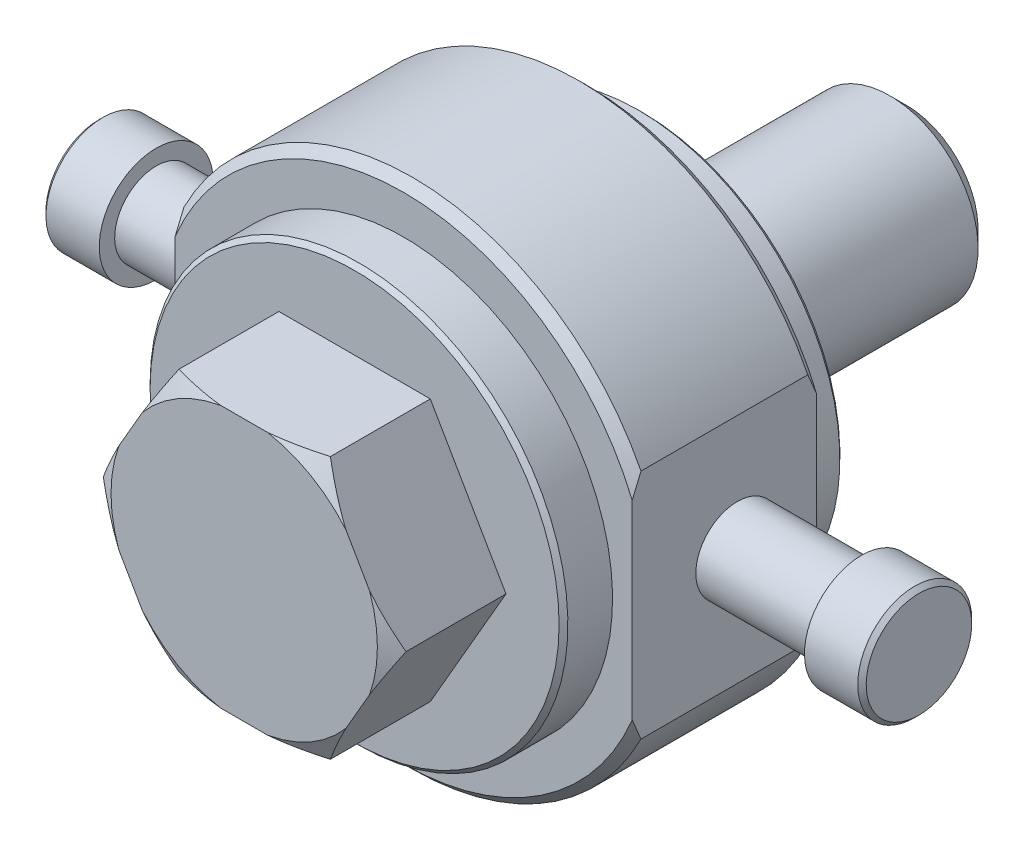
ISO-10303-21;
HEADER;
FILE_DESCRIPTION(('STEP AP214'),'2;1');
FILE_NAME('part.step','',(''),(''),'','','');
FILE_SCHEMA(('AUTOMOTIVE_DESIGN { 1 0 10303 214 1 1 1 1 }'));
ENDSEC;
DATA;
#1=APPLICATION_CONTEXT('core data for automotive mechanical design processes');
#2=APPLICATION_PROTOCOL_DEFINITION('international standard','automotive_design',2000,#1);
#3=PRODUCT_CONTEXT('',#1,'mechanical');
#4=PRODUCT('Part','Part','',(#3));
#5=PRODUCT_RELATED_PRODUCT_CATEGORY('part','',(#4));
#6=PRODUCT_DEFINITION_FORMATION('','',#4);
#7=PRODUCT_DEFINITION_CONTEXT('part definition',#1,'design');
#8=PRODUCT_DEFINITION('design','',#6,#7);
#9=PRODUCT_DEFINITION_SHAPE('','',#8);
#10=(LENGTH_UNIT() NAMED_UNIT(*) SI_UNIT(.MILLI.,.METRE.));
#11=(NAMED_UNIT(*) PLANE_ANGLE_UNIT() SI_UNIT($,.RADIAN.));
#12=(NAMED_UNIT(*) SI_UNIT($,.STERADIAN.) SOLID_ANGLE_UNIT());
#13=UNCERTAINTY_MEASURE_WITH_UNIT(LENGTH_MEASURE(1.E-05),#10,'distance_accuracy_value','');
#14=(GEOMETRIC_REPRESENTATION_CONTEXT(3) GLOBAL_UNCERTAINTY_ASSIGNED_CONTEXT((#13)) GLOBAL_UNIT_ASSIGNED_CONTEXT((#10,
#11,#12)) REPRESENTATION_CONTEXT('',''));
#15=CARTESIAN_POINT('',(0.,0.,0.));
#16=DIRECTION('',(0.,0.,1.));
#17=DIRECTION('',(1.,0.,0.));
#18=AXIS2_PLACEMENT_3D('',#15,#16,#17);
#19=CARTESIAN_POINT('',(0.,0.,144.399));
#20=DIRECTION('',(0.,0.,-1.));
#21=DIRECTION('',(0.,-1.,0.));
#22=AXIS2_PLACEMENT_3D('',#19,#20,#21);
#23=CONICAL_SURFACE('',#22,48.26,1.04719755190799);
#24=CARTESIAN_POINT('',(-54.8459661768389,6.60930012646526E-09,140.596590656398));
#25=CARTESIAN_POINT('',(-54.4596404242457,-0.669135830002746,140.819626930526));
#26=CARTESIAN_POINT('',(-54.0723837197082,-1.33988411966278,141.036148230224));
#27=CARTESIAN_POINT('',(-53.2959341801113,-2.68473417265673,141.455038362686));
#28=CARTESIAN_POINT('',(-52.9067412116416,-3.35883616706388,141.657406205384));
#29=CARTESIAN_POINT('',(-51.7378606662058,-5.3833966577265,142.240735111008));
#30=CARTESIAN_POINT('',(-50.9552548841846,-6.73890963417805,142.598864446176));
#31=CARTESIAN_POINT('',(-49.7757937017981,-8.78179632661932,143.083112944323));
#32=CARTESIAN_POINT('',(-49.3816221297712,-9.46452151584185,143.235734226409));
#33=CARTESIAN_POINT('',(-48.5915649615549,-10.8329406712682,143.522113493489));
#34=CARTESIAN_POINT('',(-48.1956793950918,-11.5186345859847,143.655871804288));
#35=CARTESIAN_POINT('',(-47.4015490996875,-12.8941086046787,143.903624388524));
#36=CARTESIAN_POINT('',(-47.0033012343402,-13.5838941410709,144.01757855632));
#37=CARTESIAN_POINT('',(-46.2054052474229,-14.9658905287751,144.224380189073));
#38=CARTESIAN_POINT('',(-45.8057570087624,-15.658101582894,144.317225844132));
#39=CARTESIAN_POINT('',(-45.4055282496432,-16.3513181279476,144.3989999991));
#40=B_SPLINE_CURVE_WITH_KNOTS('',3,(#24,#25,#26,#27,#28,#29,#30,#31,#32,#33,#34,#35,#36,#37,#38,
#39),.UNSPECIFIED.,.F.,.F.,(4,2,2,2,2,2,2,4),(0.,2.41252005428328,4.82520870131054,
9.640488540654,12.049250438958,14.4579707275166,16.8715135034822,19.2852631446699),.UNSPECIFIED.);
#41=CARTESIAN_POINT('',(-54.8459661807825,0.,140.596590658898));
#42=VERTEX_POINT('',#41);
#43=CARTESIAN_POINT('',(-45.405528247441,-16.351318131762,144.39899999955));
#44=VERTEX_POINT('',#43);
#45=EDGE_CURVE('E768',#42,#44,#40,.T.);
#46=ORIENTED_EDGE('',*,*,#45,.T.);
#47=CARTESIAN_POINT('',(0.,0.,144.399));
#48=DIRECTION('',(0.,0.,-1.));
#49=DIRECTION('',(0.,-1.,0.));
#50=AXIS2_PLACEMENT_3D('',#47,#48,#49);
#51=CIRCLE('',#50,48.26);
#52=CARTESIAN_POINT('',(-45.4055282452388,16.3513181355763,144.399));
#53=VERTEX_POINT('',#52);
#54=EDGE_CURVE('E877',#53,#44,#51,.F.);
#55=ORIENTED_EDGE('',*,*,#54,.F.);
#56=CARTESIAN_POINT('',(-45.4055282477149,16.3513181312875,144.398999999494));
#57=CARTESIAN_POINT('',(-45.8057570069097,15.658101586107,144.317225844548));
#58=CARTESIAN_POINT('',(-46.2054052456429,14.9658905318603,144.224380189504));
#59=CARTESIAN_POINT('',(-47.0033012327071,13.5838941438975,144.017578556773));
#60=CARTESIAN_POINT('',(-47.4015490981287,12.8941086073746,143.903624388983));
#61=CARTESIAN_POINT('',(-48.1956793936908,11.5186345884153,143.655871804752));
#62=CARTESIAN_POINT('',(-48.5915649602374,10.8329406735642,143.522113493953));
#63=CARTESIAN_POINT('',(-49.3816221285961,9.46452151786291,143.235734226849));
#64=CARTESIAN_POINT('',(-49.775793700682,8.78179632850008,143.083112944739));
#65=CARTESIAN_POINT('',(-50.955254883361,6.7389096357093,142.598864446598));
#66=CARTESIAN_POINT('',(-51.7378606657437,5.38339665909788,142.24073511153));
#67=CARTESIAN_POINT('',(-52.9067412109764,3.35883616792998,141.65740620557));
#68=CARTESIAN_POINT('',(-53.2959341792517,2.68473417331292,141.455038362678));
#69=CARTESIAN_POINT('',(-54.0723837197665,1.33988412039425,141.036148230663));
#70=CARTESIAN_POINT('',(-54.4596404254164,0.669135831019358,140.819626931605));
#71=CARTESIAN_POINT('',(-54.8459661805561,-4.77364459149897E-09,140.596590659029));
#72=B_SPLINE_CURVE_WITH_KNOTS('',3,(#56,#57,#58,#59,#60,#61,#62,#63,#64,#65,#66,#67,#68,#69,#70,
#71),.UNSPECIFIED.,.F.,.F.,(4,2,2,2,2,2,2,4),(0.,2.41374964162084,4.82729241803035,
7.23601270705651,9.64477460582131,14.4600544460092,16.872743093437,19.2852631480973),.UNSPECIFIED.);
#73=EDGE_CURVE('E776',#53,#42,#72,.T.);
#74=ORIENTED_EDGE('',*,*,#73,.T.);
#75=EDGE_LOOP('',(#46,#55,#74));
#76=FACE_BOUND('',#75,.T.);
#77=ADVANCED_FACE('F14',(#76),#23,.T.);
#78=CARTESIAN_POINT('',(0.,0.,144.399));
#79=DIRECTION('',(0.,0.,-1.));
#80=DIRECTION('',(0.,-1.,0.));
#81=AXIS2_PLACEMENT_3D('',#78,#79,#80);
#82=CONICAL_SURFACE('',#81,48.26,1.04719755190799);
#83=CARTESIAN_POINT('',(-27.4229830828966,-47.4979999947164,140.596590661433));
#84=CARTESIAN_POINT('',(-26.65033157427,-47.4979999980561,140.819626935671));
#85=CARTESIAN_POINT('',(-25.8758181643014,-47.4979999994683,141.036148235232));
#86=CARTESIAN_POINT('',(-24.3229190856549,-47.4980000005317,141.455038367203));
#87=CARTESIAN_POINT('',(-23.5445331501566,-47.4980000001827,141.657406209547));
#88=CARTESIAN_POINT('',(-21.2067720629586,-47.4979999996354,142.2407351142));
#89=CARTESIAN_POINT('',(-19.6415605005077,-47.4979999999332,142.598864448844));
#90=CARTESIAN_POINT('',(-17.2826381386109,-47.4980000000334,143.083112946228));
#91=CARTESIAN_POINT('',(-16.4942949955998,-47.498000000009,143.235734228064));
#92=CARTESIAN_POINT('',(-14.9141806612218,-47.497999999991,143.522113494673));
#93=CARTESIAN_POINT('',(-14.1224095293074,-47.4979999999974,143.655871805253));
#94=CARTESIAN_POINT('',(-12.5341489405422,-47.4980000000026,143.903624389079));
#95=CARTESIAN_POINT('',(-11.7376532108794,-47.4980000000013,144.017578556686));
#96=CARTESIAN_POINT('',(-10.1418612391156,-47.4979999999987,144.224380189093));
#97=CARTESIAN_POINT('',(-9.34256476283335,-47.4979999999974,144.317225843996));
#98=CARTESIAN_POINT('',(-8.54210724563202,-47.498,144.398999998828));
#99=B_SPLINE_CURVE_WITH_KNOTS('',3,(#83,#84,#85,#86,#87,#88,#89,#90,#91,#92,#93,#94,#95,#96,#97,
#98),.UNSPECIFIED.,.F.,.F.,(4,2,2,2,2,2,2,4),(0.,2.41252005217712,4.82520869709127,
9.64048853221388,12.0492504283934,14.4579707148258,16.8715134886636,19.2852631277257),.UNSPECIFIED.);
#100=CARTESIAN_POINT('',(-27.4229830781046,-47.4980000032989,140.596590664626));
#101=VERTEX_POINT('',#100);
#102=CARTESIAN_POINT('',(-8.54210723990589,-47.498,144.398999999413));
#103=VERTEX_POINT('',#102);
#104=EDGE_CURVE('E784',#101,#103,#99,.T.);
#105=ORIENTED_EDGE('',*,*,#104,.T.);
#106=CARTESIAN_POINT('',(0.,0.,144.399));
#107=DIRECTION('',(0.,0.,-1.));
#108=DIRECTION('',(0.,-1.,0.));
#109=AXIS2_PLACEMENT_3D('',#106,#107,#108);
#110=CIRCLE('',#109,48.26);
#111=CARTESIAN_POINT('',(-36.8634209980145,-31.1466818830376,144.399));
#112=VERTEX_POINT('',#111);
#113=EDGE_CURVE('E860',#112,#103,#110,.F.);
#114=ORIENTED_EDGE('',*,*,#113,.F.);
#115=CARTESIAN_POINT('',(-36.8634210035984,-31.1466818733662,144.399000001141));
#116=CARTESIAN_POINT('',(-36.4631922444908,-31.8398984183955,144.317225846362));
#117=CARTESIAN_POINT('',(-36.0635440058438,-32.5321094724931,144.224380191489));
#118=CARTESIAN_POINT('',(-35.2656480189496,-33.9141058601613,144.017578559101));
#119=CARTESIAN_POINT('',(-34.8674001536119,-34.6038913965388,143.903624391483));
#120=CARTESIAN_POINT('',(-34.0732698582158,-35.9793654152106,143.6558718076));
#121=CARTESIAN_POINT('',(-33.6773842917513,-36.6650593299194,143.522113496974));
#122=CARTESIAN_POINT('',(-32.8873271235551,-38.0334784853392,143.235734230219));
#123=CARTESIAN_POINT('',(-32.4931555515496,-38.7162036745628,143.083112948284));
#124=CARTESIAN_POINT('',(-31.3136943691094,-40.7590903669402,142.598864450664));
#125=CARTESIAN_POINT('',(-30.5310885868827,-42.1146033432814,142.240735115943));
#126=CARTESIAN_POINT('',(-29.3622080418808,-44.1391638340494,141.657406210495));
#127=CARTESIAN_POINT('',(-28.9730150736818,-44.8132658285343,141.455038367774));
#128=CARTESIAN_POINT('',(-28.1965655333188,-46.15811588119,141.036148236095));
#129=CARTESIAN_POINT('',(-27.8093088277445,-46.8288641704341,140.819626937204));
#130=CARTESIAN_POINT('',(-27.4229830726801,-47.4980000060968,140.596590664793));
#131=B_SPLINE_CURVE_WITH_KNOTS('',3,(#115,#116,#117,#118,#119,#120,#121,#122,#123,#124,#125,
#126,#127,#128,#129,#130),.UNSPECIFIED.,.F.,.F.,(4,2,2,2,2,2,2,4),(0.,2.41374964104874,
4.82729241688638,7.23601270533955,9.6447746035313,14.4600544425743,16.8727430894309,
19.28526314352),.UNSPECIFIED.);
#132=EDGE_CURVE('E847',#112,#101,#131,.T.);
#133=ORIENTED_EDGE('',*,*,#132,.T.);
#134=EDGE_LOOP('',(#105,#114,#133));
#135=FACE_BOUND('',#134,.T.);
#136=ADVANCED_FACE('F741',(#135),#82,.T.);
#137=CARTESIAN_POINT('',(0.,0.,144.399));
#138=DIRECTION('',(0.,0.,-1.));
#139=DIRECTION('',(0.,-1.,0.));
#140=AXIS2_PLACEMENT_3D('',#137,#138,#139);
#141=CONICAL_SURFACE('',#140,48.26,1.04719755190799);
#142=CARTESIAN_POINT('',(0.,0.,144.399));
#143=DIRECTION('',(0.,0.,-1.));
#144=DIRECTION('',(0.,-1.,0.));
#145=AXIS2_PLACEMENT_3D('',#142,#143,#144);
#146=CIRCLE('',#145,48.26);
#147=CARTESIAN_POINT('',(8.54210723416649,-47.498,144.399));
#148=VERTEX_POINT('',#147);
#149=CARTESIAN_POINT('',(36.8634210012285,-31.1466818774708,144.399000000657));
#150=VERTEX_POINT('',#149);
#151=EDGE_CURVE('E869',#148,#150,#146,.F.);
#152=ORIENTED_EDGE('',*,*,#151,.F.);
#153=CARTESIAN_POINT('',(8.54210724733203,-47.4979999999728,144.398999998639));
#154=CARTESIAN_POINT('',(9.34256476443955,-47.4979999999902,144.317225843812));
#155=CARTESIAN_POINT('',(10.1418612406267,-47.4979999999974,144.224380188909));
#156=CARTESIAN_POINT('',(11.7376532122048,-47.4980000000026,144.017578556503));
#157=CARTESIAN_POINT('',(12.5341489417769,-47.4980000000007,143.903624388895));
#158=CARTESIAN_POINT('',(14.1224095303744,-47.4979999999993,143.655871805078));
#159=CARTESIAN_POINT('',(14.9141806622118,-47.4979999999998,143.522113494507));
#160=CARTESIAN_POINT('',(16.4942949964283,-47.4980000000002,143.2357342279));
#161=CARTESIAN_POINT('',(17.2826381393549,-47.4980000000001,143.083112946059));
#162=CARTESIAN_POINT('',(19.6415605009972,-47.4979999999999,142.598864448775));
#163=CARTESIAN_POINT('',(21.2067720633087,-47.498,142.240735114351));
#164=CARTESIAN_POINT('',(23.5445331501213,-47.498,141.657406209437));
#165=CARTESIAN_POINT('',(24.3229190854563,-47.498,141.455038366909));
#166=CARTESIAN_POINT('',(25.8758181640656,-47.498,141.036148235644));
#167=CARTESIAN_POINT('',(26.6503315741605,-47.498,140.819626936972));
#168=CARTESIAN_POINT('',(27.42298308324,-47.498,140.596590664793));
#169=B_SPLINE_CURVE_WITH_KNOTS('',3,(#153,#154,#155,#156,#157,#158,#159,#160,#161,#162,#163,
#164,#165,#166,#167,#168),.UNSPECIFIED.,.F.,.F.,(4,2,2,2,2,2,2,4),(0.,2.41374963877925,
4.82729241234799,7.23601269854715,9.64477459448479,14.4600544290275,16.8727430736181,
19.285263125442),.UNSPECIFIED.);
#170=CARTESIAN_POINT('',(27.4229830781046,-47.4980000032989,140.596590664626));
#171=VERTEX_POINT('',#170);
#172=EDGE_CURVE('E841',#148,#171,#169,.T.);
#173=ORIENTED_EDGE('',*,*,#172,.T.);
#174=CARTESIAN_POINT('',(27.422983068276,-47.4980000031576,140.596590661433));
#175=CARTESIAN_POINT('',(27.809308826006,-46.8288641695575,140.819626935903));
#176=CARTESIAN_POINT('',(28.1965655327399,-46.1581158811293,141.036148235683));
#177=CARTESIAN_POINT('',(28.9730150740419,-44.8132658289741,141.455038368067));
#178=CARTESIAN_POINT('',(29.3622080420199,-44.1391638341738,141.657406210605));
#179=CARTESIAN_POINT('',(30.5310885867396,-42.1146033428,142.240735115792));
#180=CARTESIAN_POINT('',(31.3136943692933,-40.7590903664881,142.598864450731));
#181=CARTESIAN_POINT('',(32.4931555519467,-38.716203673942,143.083112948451));
#182=CARTESIAN_POINT('',(32.8873271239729,-38.0334784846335,143.235734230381));
#183=CARTESIAN_POINT('',(33.6773842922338,-36.6650593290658,143.522113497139));
#184=CARTESIAN_POINT('',(34.073269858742,-35.9793654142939,143.655871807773));
#185=CARTESIAN_POINT('',(34.8674001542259,-34.6038913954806,143.903624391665));
#186=CARTESIAN_POINT('',(35.2656480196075,-33.9141058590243,144.017578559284));
#187=CARTESIAN_POINT('',(36.063544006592,-32.5321094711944,144.22438019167));
#188=CARTESIAN_POINT('',(36.4631922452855,-31.8398984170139,144.317225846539));
#189=CARTESIAN_POINT('',(36.8634210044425,-31.146681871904,144.399000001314));
#190=B_SPLINE_CURVE_WITH_KNOTS('',3,(#174,#175,#176,#177,#178,#179,#180,#181,#182,#183,#184,
#185,#186,#187,#188,#189),.UNSPECIFIED.,.F.,.F.,(4,2,2,2,2,2,2,4),(0.,2.41252005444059,
4.82520870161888,9.64048854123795,12.0492504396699,14.4579707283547,16.8715135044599,
19.2852631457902),.UNSPECIFIED.);
#191=EDGE_CURVE('E136',#171,#150,#190,.T.);
#192=ORIENTED_EDGE('',*,*,#191,.T.);
#193=EDGE_LOOP('',(#152,#173,#192));
#194=FACE_BOUND('',#193,.T.);
#195=ADVANCED_FACE('F583',(#194),#141,.T.);
#196=CARTESIAN_POINT('',(0.,0.,144.399));
#197=DIRECTION('',(0.,0.,-1.));
#198=DIRECTION('',(0.,-1.,0.));
#199=AXIS2_PLACEMENT_3D('',#196,#197,#198);
#200=CONICAL_SURFACE('',#199,48.26,1.04719755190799);
#201=CARTESIAN_POINT('',(54.8459661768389,-6.60929896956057E-09,140.596590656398));
#202=CARTESIAN_POINT('',(54.4596404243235,0.669135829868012,140.819626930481));
#203=CARTESIAN_POINT('',(54.0723837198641,1.33988411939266,141.036148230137));
#204=CARTESIAN_POINT('',(53.2959341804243,2.68473417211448,141.45503836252));
#205=CARTESIAN_POINT('',(52.9067412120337,3.35883616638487,141.657406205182));
#206=CARTESIAN_POINT('',(51.7378606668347,5.38339665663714,142.240735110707));
#207=CARTESIAN_POINT('',(50.9552548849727,6.73890963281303,142.598864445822));
#208=CARTESIAN_POINT('',(49.775793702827,8.78179632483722,143.083112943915));
#209=CARTESIAN_POINT('',(49.3816221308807,9.46452151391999,143.235734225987));
#210=CARTESIAN_POINT('',(48.5915649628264,10.8329406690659,143.522113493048));
#211=CARTESIAN_POINT('',(48.1956793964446,11.5186345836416,143.655871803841));
#212=CARTESIAN_POINT('',(47.4015491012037,12.8941086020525,143.903624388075));
#213=CARTESIAN_POINT('',(47.0033012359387,13.5838941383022,144.017578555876));
#214=CARTESIAN_POINT('',(46.2054052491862,14.9658905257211,144.224380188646));
#215=CARTESIAN_POINT('',(45.8057570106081,15.6581015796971,144.317225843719));
#216=CARTESIAN_POINT('',(45.4055282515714,16.3513181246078,144.398999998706));
#217=B_SPLINE_CURVE_WITH_KNOTS('',3,(#201,#202,#203,#204,#205,#206,#207,#208,#209,#210,#211,
#212,#213,#214,#215,#216),.UNSPECIFIED.,.F.,.F.,(4,2,2,2,2,2,2,4),(0.,2.41252005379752,
4.82520870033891,9.64048853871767,12.0492504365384,14.4579707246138,16.8715135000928,
19.2852631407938),.UNSPECIFIED.);
#218=CARTESIAN_POINT('',(54.8459661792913,2.58292614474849E-09,140.596590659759));
#219=VERTEX_POINT('',#218);
#220=CARTESIAN_POINT('',(45.4055282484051,16.3513181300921,144.398999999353));
#221=VERTEX_POINT('',#220);
#222=EDGE_CURVE('E128',#219,#221,#217,.T.);
#223=ORIENTED_EDGE('',*,*,#222,.T.);
#224=CARTESIAN_POINT('',(0.,0.,144.399));
#225=DIRECTION('',(0.,0.,-1.));
#226=DIRECTION('',(0.,-1.,0.));
#227=AXIS2_PLACEMENT_3D('',#224,#225,#226);
#228=CIRCLE('',#227,48.26);
#229=CARTESIAN_POINT('',(45.4055282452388,-16.3513181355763,144.399));
#230=VERTEX_POINT('',#229);
#231=EDGE_CURVE('E125',#230,#221,#228,.F.);
#232=ORIENTED_EDGE('',*,*,#231,.F.);
#233=CARTESIAN_POINT('',(45.4055282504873,-16.3513181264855,144.398999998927));
#234=CARTESIAN_POINT('',(45.8057570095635,-15.6581015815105,144.317225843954));
#235=CARTESIAN_POINT('',(46.2054052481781,-14.9658905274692,144.224380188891));
#236=CARTESIAN_POINT('',(47.0033012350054,-13.5838941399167,144.017578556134));
#237=CARTESIAN_POINT('',(47.4015491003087,-12.8941086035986,143.903624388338));
#238=CARTESIAN_POINT('',(48.1956793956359,-11.5186345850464,143.65587180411));
#239=CARTESIAN_POINT('',(48.5915649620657,-10.8329406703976,143.522113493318));
#240=CARTESIAN_POINT('',(49.3816221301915,-9.46452151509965,143.235734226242));
#241=CARTESIAN_POINT('',(49.7757937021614,-8.78179632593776,143.083112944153));
#242=CARTESIAN_POINT('',(50.9552548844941,-6.73890963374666,142.59886444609));
#243=CARTESIAN_POINT('',(51.737860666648,-5.38339665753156,142.240735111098));
#244=CARTESIAN_POINT('',(52.9067412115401,-3.35883616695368,141.657406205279));
#245=CARTESIAN_POINT('',(53.2959341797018,-2.68473417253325,141.45503836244));
#246=CARTESIAN_POINT('',(54.0723837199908,-1.33988412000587,141.036148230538));
#247=CARTESIAN_POINT('',(54.4596404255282,-0.669135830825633,140.819626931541));
#248=CARTESIAN_POINT('',(54.8459661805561,4.77365081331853E-09,140.596590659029));
#249=B_SPLINE_CURVE_WITH_KNOTS('',3,(#233,#234,#235,#236,#237,#238,#239,#240,#241,#242,#243,
#244,#245,#246,#247,#248),.UNSPECIFIED.,.F.,.F.,(4,2,2,2,2,2,2,4),(0.,2.413749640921,
4.82729241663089,7.23601270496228,9.64477460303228,14.4600544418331,16.8727430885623,
19.2852631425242),.UNSPECIFIED.);
#250=EDGE_CURVE('E131',#230,#219,#249,.T.);
#251=ORIENTED_EDGE('',*,*,#250,.T.);
#252=EDGE_LOOP('',(#223,#232,#251));
#253=FACE_BOUND('',#252,.T.);
#254=ADVANCED_FACE('F129',(#253),#200,.T.);
#255=CARTESIAN_POINT('',(0.,0.,144.399));
#256=DIRECTION('',(0.,0.,-1.));
#257=DIRECTION('',(0.,-1.,0.));
#258=AXIS2_PLACEMENT_3D('',#255,#256,#257);
#259=CONICAL_SURFACE('',#258,48.26,1.04719755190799);
#260=CARTESIAN_POINT('',(-27.422983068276,47.4980000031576,140.596590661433));
#261=CARTESIAN_POINT('',(-27.8093088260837,46.8288641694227,140.819626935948));
#262=CARTESIAN_POINT('',(-28.1965655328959,46.1581158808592,141.03614823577));
#263=CARTESIAN_POINT('',(-28.9730150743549,44.8132658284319,141.455038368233));
#264=CARTESIAN_POINT('',(-29.362208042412,44.1391638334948,141.657406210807));
#265=CARTESIAN_POINT('',(-30.5310885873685,42.1146033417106,142.240735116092));
#266=CARTESIAN_POINT('',(-31.3136943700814,40.759090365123,142.598864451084));
#267=CARTESIAN_POINT('',(-32.4931555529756,38.7162036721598,143.083112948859));
#268=CARTESIAN_POINT('',(-32.8873271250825,38.0334784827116,143.235734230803));
#269=CARTESIAN_POINT('',(-33.6773842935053,36.6650593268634,143.52211349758));
#270=CARTESIAN_POINT('',(-34.0732698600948,35.9793654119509,143.655871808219));
#271=CARTESIAN_POINT('',(-34.8674001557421,34.6038913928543,143.903624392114));
#272=CARTESIAN_POINT('',(-35.265648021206,33.9141058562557,144.017578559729));
#273=CARTESIAN_POINT('',(-36.0635440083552,32.5321094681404,144.224380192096));
#274=CARTESIAN_POINT('',(-36.4631922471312,31.839898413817,144.317225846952));
#275=CARTESIAN_POINT('',(-36.8634210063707,31.1466818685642,144.399000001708));
#276=B_SPLINE_CURVE_WITH_KNOTS('',3,(#260,#261,#262,#263,#264,#265,#266,#267,#268,#269,#270,
#271,#272,#273,#274,#275),.UNSPECIFIED.,.F.,.F.,(4,2,2,2,2,2,2,4),(0.,2.41252005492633,
4.82520870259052,9.6404885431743,12.0492504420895,14.4579707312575,16.8715135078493,
19.2852631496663),.UNSPECIFIED.);
#277=CARTESIAN_POINT('',(-27.4229830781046,47.4980000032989,140.596590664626));
#278=VERTEX_POINT('',#277);
#279=CARTESIAN_POINT('',(-36.8634210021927,31.1466818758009,144.399000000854));
#280=VERTEX_POINT('',#279);
#281=EDGE_CURVE('E791',#278,#280,#276,.T.);
#282=ORIENTED_EDGE('',*,*,#281,.T.);
#283=CARTESIAN_POINT('',(0.,0.,144.399));
#284=DIRECTION('',(0.,0.,-1.));
#285=DIRECTION('',(0.,-1.,0.));
#286=AXIS2_PLACEMENT_3D('',#283,#284,#285);
#287=CIRCLE('',#286,48.26);
#288=CARTESIAN_POINT('',(-8.54210723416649,47.498,144.399));
#289=VERTEX_POINT('',#288);
#290=EDGE_CURVE('E883',#289,#280,#287,.F.);
#291=ORIENTED_EDGE('',*,*,#290,.F.);
#292=CARTESIAN_POINT('',(-8.54210724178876,47.498,144.398999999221));
#293=CARTESIAN_POINT('',(-9.3425647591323,47.498,144.317225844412));
#294=CARTESIAN_POINT('',(-10.1418612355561,47.498,144.224380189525));
#295=CARTESIAN_POINT('',(-11.7376532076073,47.498,144.01757855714));
#296=CARTESIAN_POINT('',(-12.5341489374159,47.498,143.90362438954));
#297=CARTESIAN_POINT('',(-14.1224095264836,47.498,143.655871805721));
#298=CARTESIAN_POINT('',(-14.9141806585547,47.498,143.522113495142));
#299=CARTESIAN_POINT('',(-16.4942949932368,47.498,143.235734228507));
#300=CARTESIAN_POINT('',(-17.2826381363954,47.498,143.083112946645));
#301=CARTESIAN_POINT('',(-19.6415604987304,47.498,142.598864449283));
#302=CARTESIAN_POINT('',(-21.2067720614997,47.498,142.240735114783));
#303=CARTESIAN_POINT('',(-23.5445331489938,47.498,141.657406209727));
#304=CARTESIAN_POINT('',(-24.3229190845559,47.498,141.455038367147));
#305=CARTESIAN_POINT('',(-25.8758181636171,47.498,141.036148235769));
#306=CARTESIAN_POINT('',(-26.6503315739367,47.498,140.819626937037));
#307=CARTESIAN_POINT('',(-27.42298308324,47.498,140.596590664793));
#308=B_SPLINE_CURVE_WITH_KNOTS('',3,(#292,#293,#294,#295,#296,#297,#298,#299,#300,#301,#302,
#303,#304,#305,#306,#307),.UNSPECIFIED.,.F.,.F.,(4,2,2,2,2,2,2,4),(0.,2.41374963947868,
4.82729241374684,7.23601270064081,9.64477459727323,14.4600544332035,16.8727430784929,
19.2852631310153),.UNSPECIFIED.);
#309=EDGE_CURVE('E802',#289,#278,#308,.T.);
#310=ORIENTED_EDGE('',*,*,#309,.T.);
#311=EDGE_LOOP('',(#282,#291,#310));
#312=FACE_BOUND('',#311,.T.);
#313=ADVANCED_FACE('F715',(#312),#259,.T.);
#314=CARTESIAN_POINT('',(0.,0.,144.399));
#315=DIRECTION('',(0.,0.,-1.));
#316=DIRECTION('',(0.,-1.,0.));
#317=AXIS2_PLACEMENT_3D('',#314,#315,#316);
#318=CONICAL_SURFACE('',#317,48.26,1.04719755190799);
#319=CARTESIAN_POINT('',(27.4229830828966,47.4979999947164,140.596590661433));
#320=CARTESIAN_POINT('',(26.6503315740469,47.4979999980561,140.819626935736));
#321=CARTESIAN_POINT('',(25.875818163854,47.4979999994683,141.036148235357));
#322=CARTESIAN_POINT('',(24.3229190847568,47.4980000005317,141.455038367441));
#323=CARTESIAN_POINT('',(23.544533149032,47.4980000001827,141.657406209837));
#324=CARTESIAN_POINT('',(21.2067720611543,47.4979999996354,142.240735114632));
#325=CARTESIAN_POINT('',(19.6415604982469,47.4979999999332,142.59886444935));
#326=CARTESIAN_POINT('',(17.2826381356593,47.4980000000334,143.083112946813));
#327=CARTESIAN_POINT('',(16.4942949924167,47.498000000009,143.235734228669));
#328=CARTESIAN_POINT('',(14.9141806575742,47.497999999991,143.522113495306));
#329=CARTESIAN_POINT('',(14.1224095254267,47.4979999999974,143.655871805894));
#330=CARTESIAN_POINT('',(12.5341489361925,47.4980000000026,143.903624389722));
#331=CARTESIAN_POINT('',(11.7376532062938,47.4980000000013,144.017578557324));
#332=CARTESIAN_POINT('',(10.1418612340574,47.4979999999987,144.224380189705));
#333=CARTESIAN_POINT('',(9.34256475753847,47.4979999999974,144.317225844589));
#334=CARTESIAN_POINT('',(8.5421072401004,47.498,144.398999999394));
#335=B_SPLINE_CURVE_WITH_KNOTS('',3,(#319,#320,#321,#322,#323,#324,#325,#326,#327,#328,#329,
#330,#331,#332,#333,#334),.UNSPECIFIED.,.F.,.F.,(4,2,2,2,2,2,2,4),(0.,2.41252005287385,
4.82520869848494,9.64048853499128,12.049250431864,14.4579707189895,16.8715134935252,
19.2852631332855),.UNSPECIFIED.);
#336=CARTESIAN_POINT('',(27.4229830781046,47.4980000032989,140.596590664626));
#337=VERTEX_POINT('',#336);
#338=CARTESIAN_POINT('',(8.54210723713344,47.498,144.398999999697));
#339=VERTEX_POINT('',#338);
#340=EDGE_CURVE('E785',#337,#339,#335,.T.);
#341=ORIENTED_EDGE('',*,*,#340,.T.);
#342=CARTESIAN_POINT('',(0.,0.,144.399));
#343=DIRECTION('',(0.,0.,-1.));
#344=DIRECTION('',(0.,-1.,0.));
#345=AXIS2_PLACEMENT_3D('',#342,#343,#344);
#346=CIRCLE('',#345,48.26);
#347=CARTESIAN_POINT('',(36.8634209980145,31.1466818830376,144.399));
#348=VERTEX_POINT('',#347);
#349=EDGE_CURVE('E152',#348,#339,#346,.F.);
#350=ORIENTED_EDGE('',*,*,#349,.F.);
#351=CARTESIAN_POINT('',(36.8634210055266,31.1466818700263,144.399000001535));
#352=CARTESIAN_POINT('',(36.4631922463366,31.8398984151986,144.317225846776));
#353=CARTESIAN_POINT('',(36.063544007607,32.532109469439,144.224380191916));
#354=CARTESIAN_POINT('',(35.2656480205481,33.9141058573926,144.017578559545));
#355=CARTESIAN_POINT('',(34.8674001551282,34.6038913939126,143.903624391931));
#356=CARTESIAN_POINT('',(34.0732698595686,35.9793654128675,143.655871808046));
#357=CARTESIAN_POINT('',(33.6773842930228,36.6650593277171,143.522113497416));
#358=CARTESIAN_POINT('',(32.8873271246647,38.0334784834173,143.235734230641));
#359=CARTESIAN_POINT('',(32.4931555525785,38.7162036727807,143.083112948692));
#360=CARTESIAN_POINT('',(31.3136943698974,40.7590903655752,142.598864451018));
#361=CARTESIAN_POINT('',(30.5310885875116,42.114603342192,142.240735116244));
#362=CARTESIAN_POINT('',(29.3622080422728,44.1391638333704,141.657406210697));
#363=CARTESIAN_POINT('',(28.9730150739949,44.8132658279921,141.455038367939));
#364=CARTESIAN_POINT('',(28.1965655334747,46.1581158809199,141.036148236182));
#365=CARTESIAN_POINT('',(27.8093088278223,46.8288641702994,140.819626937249));
#366=CARTESIAN_POINT('',(27.42298307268,47.4980000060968,140.596590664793));
#367=B_SPLINE_CURVE_WITH_KNOTS('',3,(#351,#352,#353,#354,#355,#356,#357,#358,#359,#360,#361,
#362,#363,#364,#365,#366),.UNSPECIFIED.,.F.,.F.,(4,2,2,2,2,2,2,4),(0.,2.41374964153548,
4.82729241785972,7.23601270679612,9.64477460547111,14.4600544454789,16.8727430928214,
19.2852631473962),.UNSPECIFIED.);
#368=EDGE_CURVE('E151',#348,#337,#367,.T.);
#369=ORIENTED_EDGE('',*,*,#368,.T.);
#370=EDGE_LOOP('',(#341,#350,#369));
#371=FACE_BOUND('',#370,.T.);
#372=ADVANCED_FACE('F678',(#371),#318,.T.);
#373=CARTESIAN_POINT('',(48.83912,-47.498,144.399));
#374=DIRECTION('',(0.,0.,1.));
#375=DIRECTION('',(0.,1.,0.));
#376=AXIS2_PLACEMENT_3D('',#373,#374,#375);
#377=PLANE('',#376);
#378=DIRECTION('',(1.,0.,0.));
#379=VECTOR('',#378,1.);
#380=CARTESIAN_POINT('',(0.,-47.498,144.399));
#381=LINE('',#380,#379);
#382=EDGE_CURVE('E863',#103,#148,#381,.T.);
#383=ORIENTED_EDGE('',*,*,#382,.T.);
#384=ORIENTED_EDGE('',*,*,#151,.T.);
#385=DIRECTION('',(0.500000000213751,0.86602540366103,0.));
#386=VECTOR('',#385,1.);
#387=CARTESIAN_POINT('',(41.134474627,-23.749,144.399));
#388=LINE('',#387,#386);
#389=EDGE_CURVE('E145',#150,#230,#388,.T.);
#390=ORIENTED_EDGE('',*,*,#389,.T.);
#391=ORIENTED_EDGE('',*,*,#231,.T.);
#392=DIRECTION('',(-0.500000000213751,0.86602540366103,0.));
#393=VECTOR('',#392,1.);
#394=CARTESIAN_POINT('',(41.134474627,23.749,144.399));
#395=LINE('',#394,#393);
#396=EDGE_CURVE('E141',#221,#348,#395,.T.);
#397=ORIENTED_EDGE('',*,*,#396,.T.);
#398=ORIENTED_EDGE('',*,*,#349,.T.);
#399=DIRECTION('',(-1.,0.,0.));
#400=VECTOR('',#399,1.);
#401=CARTESIAN_POINT('',(0.,47.498,144.399));
#402=LINE('',#401,#400);
#403=EDGE_CURVE('E154',#339,#289,#402,.T.);
#404=ORIENTED_EDGE('',*,*,#403,.T.);
#405=ORIENTED_EDGE('',*,*,#290,.T.);
#406=DIRECTION('',(-0.500000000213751,-0.86602540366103,0.));
#407=VECTOR('',#406,1.);
#408=CARTESIAN_POINT('',(-41.134474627,23.749,144.399));
#409=LINE('',#408,#407);
#410=EDGE_CURVE('E880',#280,#53,#409,.T.);
#411=ORIENTED_EDGE('',*,*,#410,.T.);
#412=ORIENTED_EDGE('',*,*,#54,.T.);
#413=DIRECTION('',(0.500000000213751,-0.86602540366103,0.));
#414=VECTOR('',#413,1.);
#415=CARTESIAN_POINT('',(-41.134474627,-23.749,144.399));
#416=LINE('',#415,#414);
#417=EDGE_CURVE('E866',#44,#112,#416,.T.);
#418=ORIENTED_EDGE('',*,*,#417,.T.);
#419=ORIENTED_EDGE('',*,*,#113,.T.);
#420=EDGE_LOOP('',(#383,#384,#390,#391,#397,#398,#404,#405,#411,#412,#418,#419));
#421=FACE_BOUND('',#420,.T.);
#422=ADVANCED_FACE('F140',(#421),#377,.T.);
#423=CARTESIAN_POINT('',(0.,0.,0.));
#424=DIRECTION('',(0.,0.,-1.));
#425=DIRECTION('',(0.,-1.,0.));
#426=AXIS2_PLACEMENT_3D('',#423,#424,#425);
#427=CYLINDRICAL_SURFACE('',#426,32.00019);
#428=CARTESIAN_POINT('',(0.,0.,-89.504));
#429=DIRECTION('',(0.,0.,-1.));
#430=DIRECTION('',(-1.,0.,0.));
#431=AXIS2_PLACEMENT_3D('',#428,#429,#430);
#432=CIRCLE('',#431,32.00019);
#433=CARTESIAN_POINT('',(-32.00019,0.,-89.504));
#434=VERTEX_POINT('',#433);
#435=EDGE_CURVE('E867',#434,#434,#432,.F.);
#436=ORIENTED_EDGE('',*,*,#435,.T.);
#437=EDGE_LOOP('',(#436));
#438=FACE_BOUND('',#437,.T.);
#439=CARTESIAN_POINT('',(0.,0.,0.));
#440=DIRECTION('',(0.,0.,-1.));
#441=DIRECTION('',(0.,-1.,0.));
#442=AXIS2_PLACEMENT_3D('',#439,#440,#441);
#443=CIRCLE('',#442,32.00019);
#444=CARTESIAN_POINT('',(0.,-32.00019,0.));
#445=VERTEX_POINT('',#444);
#446=EDGE_CURVE('E165',#445,#445,#443,.F.);
#447=ORIENTED_EDGE('',*,*,#446,.F.);
#448=EDGE_LOOP('',(#447));
#449=FACE_BOUND('',#448,.T.);
#450=ADVANCED_FACE('F438',(#438,#449),#427,.T.);
#451=CARTESIAN_POINT('',(-54.8459661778,0.,104.394));
#452=DIRECTION('',(0.86602540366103,-0.500000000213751,0.));
#453=DIRECTION('',(0.500000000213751,0.86602540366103,0.));
#454=AXIS2_PLACEMENT_3D('',#451,#452,#453);
#455=PLANE('',#454);
#456=ORIENTED_EDGE('',*,*,#410,.F.);
#457=ORIENTED_EDGE('',*,*,#281,.F.);
#458=DIRECTION('',(0.,0.,-1.));
#459=VECTOR('',#458,1.);
#460=CARTESIAN_POINT('',(-27.4229830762,47.498,124.3965));
#461=LINE('',#460,#459);
#462=CARTESIAN_POINT('',(-27.4229831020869,47.497999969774,104.394));
#463=VERTEX_POINT('',#462);
#464=EDGE_CURVE('E158',#278,#463,#461,.T.);
#465=ORIENTED_EDGE('',*,*,#464,.T.);
#466=DIRECTION('',(0.499999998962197,0.866025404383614,0.));
#467=VECTOR('',#466,1.);
#468=CARTESIAN_POINT('',(-54.8459660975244,0.,104.394));
#469=LINE('',#468,#467);
#470=CARTESIAN_POINT('',(-54.8459661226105,8.69009798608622E-09,104.394));
#471=VERTEX_POINT('',#470);
#472=EDGE_CURVE('E898',#471,#463,#469,.T.);
#473=ORIENTED_EDGE('',*,*,#472,.F.);
#474=DIRECTION('',(0.,0.,-1.));
#475=VECTOR('',#474,1.);
#476=CARTESIAN_POINT('',(-54.8459661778,0.,124.3965));
#477=LINE('',#476,#475);
#478=EDGE_CURVE('E879',#42,#471,#477,.T.);
#479=ORIENTED_EDGE('',*,*,#478,.F.);
#480=ORIENTED_EDGE('',*,*,#73,.F.);
#481=EDGE_LOOP('',(#456,#457,#465,#473,#479,#480));
#482=FACE_BOUND('',#481,.T.);
#483=ADVANCED_FACE('F441',(#482),#455,.F.);
#484=CARTESIAN_POINT('',(-27.4229830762,-47.498,104.394));
#485=DIRECTION('',(0.86602540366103,0.500000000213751,0.));
#486=DIRECTION('',(-0.500000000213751,0.86602540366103,0.));
#487=AXIS2_PLACEMENT_3D('',#484,#485,#486);
#488=PLANE('',#487);
#489=ORIENTED_EDGE('',*,*,#417,.F.);
#490=ORIENTED_EDGE('',*,*,#45,.F.);
#491=ORIENTED_EDGE('',*,*,#478,.T.);
#492=DIRECTION('',(-0.499999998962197,0.866025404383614,0.));
#493=VECTOR('',#492,1.);
#494=CARTESIAN_POINT('',(-27.4229831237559,-47.4979999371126,104.394));
#495=LINE('',#494,#493);
#496=CARTESIAN_POINT('',(-27.4229831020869,-47.4979999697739,104.394));
#497=VERTEX_POINT('',#496);
#498=EDGE_CURVE('E237',#497,#471,#495,.T.);
#499=ORIENTED_EDGE('',*,*,#498,.F.);
#500=DIRECTION('',(0.,0.,-1.));
#501=VECTOR('',#500,1.);
#502=CARTESIAN_POINT('',(-27.4229830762,-47.498,124.3965));
#503=LINE('',#502,#501);
#504=EDGE_CURVE('E875',#101,#497,#503,.T.);
#505=ORIENTED_EDGE('',*,*,#504,.F.);
#506=ORIENTED_EDGE('',*,*,#132,.F.);
#507=EDGE_LOOP('',(#489,#490,#491,#499,#505,#506));
#508=FACE_BOUND('',#507,.T.);
#509=ADVANCED_FACE('F685',(#508),#488,.F.);
#510=CARTESIAN_POINT('',(27.4229830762,-47.498,104.394));
#511=DIRECTION('',(0.,1.,0.));
#512=DIRECTION('',(-1.,0.,0.));
#513=AXIS2_PLACEMENT_3D('',#510,#511,#512);
#514=PLANE('',#513);
#515=ORIENTED_EDGE('',*,*,#382,.F.);
#516=ORIENTED_EDGE('',*,*,#104,.F.);
#517=ORIENTED_EDGE('',*,*,#504,.T.);
#518=DIRECTION('',(-1.,0.,0.));
#519=VECTOR('',#518,1.);
#520=CARTESIAN_POINT('',(0.,-47.4979999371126,104.394));
#521=LINE('',#520,#519);
#522=CARTESIAN_POINT('',(27.4229831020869,-47.4979999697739,104.394));
#523=VERTEX_POINT('',#522);
#524=EDGE_CURVE('E234',#523,#497,#521,.T.);
#525=ORIENTED_EDGE('',*,*,#524,.F.);
#526=DIRECTION('',(0.,0.,-1.));
#527=VECTOR('',#526,1.);
#528=CARTESIAN_POINT('',(27.4229830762,-47.498,124.3965));
#529=LINE('',#528,#527);
#530=EDGE_CURVE('E163',#171,#523,#529,.T.);
#531=ORIENTED_EDGE('',*,*,#530,.F.);
#532=ORIENTED_EDGE('',*,*,#172,.F.);
#533=EDGE_LOOP('',(#515,#516,#517,#525,#531,#532));
#534=FACE_BOUND('',#533,.T.);
#535=ADVANCED_FACE('F675',(#534),#514,.F.);
#536=CARTESIAN_POINT('',(54.8459661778,0.,104.394));
#537=DIRECTION('',(-0.86602540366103,0.500000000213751,0.));
#538=DIRECTION('',(-0.500000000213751,-0.86602540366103,0.));
#539=AXIS2_PLACEMENT_3D('',#536,#537,#538);
#540=PLANE('',#539);
#541=ORIENTED_EDGE('',*,*,#389,.F.);
#542=ORIENTED_EDGE('',*,*,#191,.F.);
#543=ORIENTED_EDGE('',*,*,#530,.T.);
#544=DIRECTION('',(-0.499999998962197,-0.866025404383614,0.));
#545=VECTOR('',#544,1.);
#546=CARTESIAN_POINT('',(54.8459660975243,0.,104.394));
#547=LINE('',#546,#545);
#548=CARTESIAN_POINT('',(54.8459661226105,-8.69009451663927E-09,104.394));
#549=VERTEX_POINT('',#548);
#550=EDGE_CURVE('E238',#549,#523,#547,.T.);
#551=ORIENTED_EDGE('',*,*,#550,.F.);
#552=DIRECTION('',(0.,0.,1.));
#553=VECTOR('',#552,1.);
#554=CARTESIAN_POINT('',(54.8459661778,0.,124.3965));
#555=LINE('',#554,#553);
#556=EDGE_CURVE('E160',#549,#219,#555,.T.);
#557=ORIENTED_EDGE('',*,*,#556,.T.);
#558=ORIENTED_EDGE('',*,*,#250,.F.);
#559=EDGE_LOOP('',(#541,#542,#543,#551,#557,#558));
#560=FACE_BOUND('',#559,.T.);
#561=ADVANCED_FACE('F667',(#560),#540,.F.);
#562=CARTESIAN_POINT('',(27.4229830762,47.498,104.394));
#563=DIRECTION('',(-0.86602540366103,-0.500000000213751,0.));
#564=DIRECTION('',(0.500000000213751,-0.86602540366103,0.));
#565=AXIS2_PLACEMENT_3D('',#562,#563,#564);
#566=PLANE('',#565);
#567=ORIENTED_EDGE('',*,*,#396,.F.);
#568=ORIENTED_EDGE('',*,*,#222,.F.);
#569=ORIENTED_EDGE('',*,*,#556,.F.);
#570=DIRECTION('',(0.499999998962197,-0.866025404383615,0.));
#571=VECTOR('',#570,1.);
#572=CARTESIAN_POINT('',(27.4229831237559,47.4979999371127,104.394));
#573=LINE('',#572,#571);
#574=CARTESIAN_POINT('',(27.4229831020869,47.497999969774,104.394));
#575=VERTEX_POINT('',#574);
#576=EDGE_CURVE('E232',#575,#549,#573,.T.);
#577=ORIENTED_EDGE('',*,*,#576,.F.);
#578=DIRECTION('',(0.,0.,-1.));
#579=VECTOR('',#578,1.);
#580=CARTESIAN_POINT('',(27.4229830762,47.498,124.3965));
#581=LINE('',#580,#579);
#582=EDGE_CURVE('E162',#337,#575,#581,.T.);
#583=ORIENTED_EDGE('',*,*,#582,.F.);
#584=ORIENTED_EDGE('',*,*,#368,.F.);
#585=EDGE_LOOP('',(#567,#568,#569,#577,#583,#584));
#586=FACE_BOUND('',#585,.T.);
#587=ADVANCED_FACE('F148',(#586),#566,.F.);
#588=CARTESIAN_POINT('',(-27.4229830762,47.498,104.394));
#589=DIRECTION('',(0.,-1.,0.));
#590=DIRECTION('',(1.,0.,0.));
#591=AXIS2_PLACEMENT_3D('',#588,#589,#590);
#592=PLANE('',#591);
#593=ORIENTED_EDGE('',*,*,#403,.F.);
#594=ORIENTED_EDGE('',*,*,#340,.F.);
#595=ORIENTED_EDGE('',*,*,#582,.T.);
#596=DIRECTION('',(1.,0.,0.));
#597=VECTOR('',#596,1.);
#598=CARTESIAN_POINT('',(0.,47.4979999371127,104.394));
#599=LINE('',#598,#597);
#600=EDGE_CURVE('E229',#463,#575,#599,.T.);
#601=ORIENTED_EDGE('',*,*,#600,.F.);
#602=ORIENTED_EDGE('',*,*,#464,.F.);
#603=ORIENTED_EDGE('',*,*,#309,.F.);
#604=EDGE_LOOP('',(#593,#594,#595,#601,#602,#603));
#605=FACE_BOUND('',#604,.T.);
#606=ADVANCED_FACE('F651',(#605),#592,.F.);
#607=CARTESIAN_POINT('',(72.29475,72.29475,0.));
#608=DIRECTION('',(0.,0.,-1.));
#609=DIRECTION('',(0.,-1.,0.));
#610=AXIS2_PLACEMENT_3D('',#607,#608,#609);
#611=PLANE('',#610);
#612=ORIENTED_EDGE('',*,*,#446,.T.);
#613=EDGE_LOOP('',(#612));
#614=FACE_BOUND('',#613,.T.);
#615=CARTESIAN_POINT('',(0.,0.,0.));
#616=DIRECTION('',(0.,0.,1.));
#617=DIRECTION('',(0.,1.,0.));
#618=AXIS2_PLACEMENT_3D('',#615,#616,#617);
#619=CIRCLE('',#618,71.4375);
#620=CARTESIAN_POINT('',(0.,71.4375,0.));
#621=VERTEX_POINT('',#620);
#622=EDGE_CURVE('E233',#621,#621,#619,.F.);
#623=ORIENTED_EDGE('',*,*,#622,.T.);
#624=EDGE_LOOP('',(#623));
#625=FACE_BOUND('',#624,.T.);
#626=ADVANCED_FACE('F327',(#614,#625),#611,.T.);
#627=CARTESIAN_POINT('',(74.993754,-74.993754,104.394));
#628=DIRECTION('',(0.,0.,1.));
#629=DIRECTION('',(0.,1.,0.));
#630=AXIS2_PLACEMENT_3D('',#627,#628,#629);
#631=PLANE('',#630);
#632=ORIENTED_EDGE('',*,*,#600,.T.);
#633=ORIENTED_EDGE('',*,*,#576,.T.);
#634=ORIENTED_EDGE('',*,*,#550,.T.);
#635=ORIENTED_EDGE('',*,*,#524,.T.);
#636=ORIENTED_EDGE('',*,*,#498,.T.);
#637=ORIENTED_EDGE('',*,*,#472,.T.);
#638=EDGE_LOOP('',(#632,#633,#634,#635,#636,#637));
#639=FACE_BOUND('',#638,.T.);
#640=CARTESIAN_POINT('',(0.,0.,104.394));
#641=DIRECTION('',(0.,0.,-1.));
#642=DIRECTION('',(-1.,0.,0.));
#643=AXIS2_PLACEMENT_3D('',#640,#641,#642);
#644=CIRCLE('',#643,74.1045);
#645=CARTESIAN_POINT('',(-74.1045,0.,104.394));
#646=VERTEX_POINT('',#645);
#647=EDGE_CURVE('E221',#646,#646,#644,.F.);
#648=ORIENTED_EDGE('',*,*,#647,.T.);
#649=EDGE_LOOP('',(#648));
#650=FACE_BOUND('',#649,.T.);
#651=ADVANCED_FACE('F443',(#639,#650),#631,.T.);
#652=CARTESIAN_POINT('',(0.,0.,0.));
#653=DIRECTION('',(0.,0.,1.));
#654=DIRECTION('',(0.,1.,0.));
#655=AXIS2_PLACEMENT_3D('',#652,#653,#654);
#656=CONICAL_SURFACE('',#655,71.4375,0.785398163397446);
#657=ORIENTED_EDGE('',*,*,#622,.F.);
#658=EDGE_LOOP('',(#657));
#659=FACE_BOUND('',#658,.T.);
#660=CARTESIAN_POINT('',(0.,0.,1.5875));
#661=DIRECTION('',(0.,0.,-1.));
#662=DIRECTION('',(0.,-1.,0.));
#663=AXIS2_PLACEMENT_3D('',#660,#661,#662);
#664=CIRCLE('',#663,73.025);
#665=CARTESIAN_POINT('',(0.,-73.025,1.5875));
#666=VERTEX_POINT('',#665);
#667=EDGE_CURVE('E217',#666,#666,#664,.T.);
#668=ORIENTED_EDGE('',*,*,#667,.T.);
#669=EDGE_LOOP('',(#668));
#670=FACE_BOUND('',#669,.T.);
#671=ADVANCED_FACE('F447',(#659,#670),#656,.T.);
#672=CARTESIAN_POINT('',(0.,0.,104.394));
#673=DIRECTION('',(0.,0.,-1.));
#674=DIRECTION('',(-1.,0.,0.));
#675=AXIS2_PLACEMENT_3D('',#672,#673,#674);
#676=CONICAL_SURFACE('',#675,74.1045,0.785398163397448);
#677=ORIENTED_EDGE('',*,*,#647,.F.);
#678=EDGE_LOOP('',(#677));
#679=FACE_BOUND('',#678,.T.);
#680=CARTESIAN_POINT('',(0.,0.,102.8065));
#681=DIRECTION('',(0.,0.,-1.));
#682=DIRECTION('',(0.,-1.,0.));
#683=AXIS2_PLACEMENT_3D('',#680,#681,#682);
#684=CIRCLE('',#683,75.692);
#685=CARTESIAN_POINT('',(0.,-75.692,102.8065));
#686=VERTEX_POINT('',#685);
#687=EDGE_CURVE('E220',#686,#686,#684,.F.);
#688=ORIENTED_EDGE('',*,*,#687,.T.);
#689=EDGE_LOOP('',(#688));
#690=FACE_BOUND('',#689,.T.);
#691=ADVANCED_FACE('F444',(#679,#690),#676,.T.);
#692=CARTESIAN_POINT('',(0.,0.,19.812));
#693=DIRECTION('',(0.,0.,-1.));
#694=DIRECTION('',(0.,-1.,0.));
#695=AXIS2_PLACEMENT_3D('',#692,#693,#694);
#696=CYLINDRICAL_SURFACE('',#695,73.025);
#697=CARTESIAN_POINT('',(0.,0.,19.812));
#698=DIRECTION('',(0.,0.,-1.));
#699=DIRECTION('',(0.,-1.,0.));
#700=AXIS2_PLACEMENT_3D('',#697,#698,#699);
#701=CIRCLE('',#700,73.025);
#702=CARTESIAN_POINT('',(0.,-73.025,19.812));
#703=VERTEX_POINT('',#702);
#704=EDGE_CURVE('E182',#703,#703,#701,.F.);
#705=ORIENTED_EDGE('',*,*,#704,.F.);
#706=EDGE_LOOP('',(#705));
#707=FACE_BOUND('',#706,.T.);
#708=ORIENTED_EDGE('',*,*,#667,.F.);
#709=EDGE_LOOP('',(#708));
#710=FACE_BOUND('',#709,.T.);
#711=ADVANCED_FACE('F302',(#707,#710),#696,.T.);
#712=CARTESIAN_POINT('',(0.,0.,102.8065));
#713=DIRECTION('',(0.,0.,-1.));
#714=DIRECTION('',(0.,-1.,0.));
#715=AXIS2_PLACEMENT_3D('',#712,#713,#714);
#716=CYLINDRICAL_SURFACE('',#715,75.692);
#717=ORIENTED_EDGE('',*,*,#687,.F.);
#718=EDGE_LOOP('',(#717));
#719=FACE_BOUND('',#718,.T.);
#720=CARTESIAN_POINT('',(0.,0.,86.614));
#721=DIRECTION('',(0.,0.,-1.));
#722=DIRECTION('',(0.,-1.,0.));
#723=AXIS2_PLACEMENT_3D('',#720,#721,#722);
#724=CIRCLE('',#723,75.692);
#725=CARTESIAN_POINT('',(0.,-75.692,86.614));
#726=VERTEX_POINT('',#725);
#727=EDGE_CURVE('E342',#726,#726,#724,.T.);
#728=ORIENTED_EDGE('',*,*,#727,.F.);
#729=EDGE_LOOP('',(#728));
#730=FACE_BOUND('',#729,.T.);
#731=ADVANCED_FACE('F326',(#719,#730),#716,.T.);
#732=CARTESIAN_POINT('',(82.804,90.770075,19.812));
#733=DIRECTION('',(0.,0.,-1.));
#734=DIRECTION('',(0.,-1.,0.));
#735=AXIS2_PLACEMENT_3D('',#732,#733,#734);
#736=PLANE('',#735);
#737=ORIENTED_EDGE('',*,*,#704,.T.);
#738=EDGE_LOOP('',(#737));
#739=FACE_BOUND('',#738,.T.);
#740=DIRECTION('',(0.,1.,0.));
#741=VECTOR('',#740,1.);
#742=CARTESIAN_POINT('',(-82.804,0.,19.812));
#743=LINE('',#742,#741);
#744=CARTESIAN_POINT('',(-82.804,-34.4741406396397,19.811999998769));
#745=VERTEX_POINT('',#744);
#746=CARTESIAN_POINT('',(-82.804,34.4741406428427,19.812));
#747=VERTEX_POINT('',#746);
#748=EDGE_CURVE('E179',#745,#747,#743,.T.);
#749=ORIENTED_EDGE('',*,*,#748,.T.);
#750=CARTESIAN_POINT('',(0.,0.,19.812));
#751=DIRECTION('',(0.,0.,1.));
#752=DIRECTION('',(0.,1.,0.));
#753=AXIS2_PLACEMENT_3D('',#750,#751,#752);
#754=CIRCLE('',#753,89.69375);
#755=CARTESIAN_POINT('',(82.804,34.4741406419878,19.8119999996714));
#756=VERTEX_POINT('',#755);
#757=EDGE_CURVE('E178',#747,#756,#754,.F.);
#758=ORIENTED_EDGE('',*,*,#757,.T.);
#759=DIRECTION('',(0.,-1.,0.));
#760=VECTOR('',#759,1.);
#761=CARTESIAN_POINT('',(82.804,0.,19.812));
#762=LINE('',#761,#760);
#763=CARTESIAN_POINT('',(82.804,-34.4741406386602,19.8119999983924));
#764=VERTEX_POINT('',#763);
#765=EDGE_CURVE('E33',#756,#764,#762,.T.);
#766=ORIENTED_EDGE('',*,*,#765,.T.);
#767=CARTESIAN_POINT('',(0.,0.,19.812));
#768=DIRECTION('',(0.,0.,1.));
#769=DIRECTION('',(0.,1.,0.));
#770=AXIS2_PLACEMENT_3D('',#767,#768,#769);
#771=CIRCLE('',#770,89.69375);
#772=EDGE_CURVE('E177',#764,#745,#771,.F.);
#773=ORIENTED_EDGE('',*,*,#772,.T.);
#774=EDGE_LOOP('',(#749,#758,#766,#773));
#775=FACE_BOUND('',#774,.T.);
#776=ADVANCED_FACE('F275',(#739,#775),#736,.T.);
#777=CARTESIAN_POINT('',(0.,0.,19.812));
#778=DIRECTION('',(0.,0.,1.));
#779=DIRECTION('',(0.,1.,0.));
#780=AXIS2_PLACEMENT_3D('',#777,#778,#779);
#781=CONICAL_SURFACE('',#780,89.69375,0.785398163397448);
#782=ORIENTED_EDGE('',*,*,#757,.F.);
#783=CARTESIAN_POINT('',(-82.804,34.4741406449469,19.8120000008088));
#784=CARTESIAN_POINT('',(-82.804,35.1131728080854,20.0576162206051));
#785=CARTESIAN_POINT('',(-82.804,35.7502501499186,20.3082980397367));
#786=CARTESIAN_POINT('',(-82.804,37.0203879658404,20.8192615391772));
#787=CARTESIAN_POINT('',(-82.804,37.653449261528,21.0795411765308));
#788=CARTESIAN_POINT('',(-82.804,38.9157106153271,21.6092701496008));
#789=CARTESIAN_POINT('',(-82.804,39.5449107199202,21.8787193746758));
#790=CARTESIAN_POINT('',(-82.804,40.7996374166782,22.4263984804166));
#791=CARTESIAN_POINT('',(-82.804,41.4251632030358,22.7046302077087));
#792=CARTESIAN_POINT('',(-82.804,42.0488086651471,22.986999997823));
#793=B_SPLINE_CURVE_WITH_KNOTS('',3,(#783,#784,#785,#786,#787,#788,#789,#790,#791,#792),
.UNSPECIFIED.,.F.,.F.,(4,2,2,2,4),(0.,2.05379486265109,4.10715505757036,6.16049048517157,
8.21426056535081),.UNSPECIFIED.);
#794=CARTESIAN_POINT('',(-82.804,42.0488086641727,22.9869999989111));
#795=VERTEX_POINT('',#794);
#796=EDGE_CURVE('E214',#747,#795,#793,.T.);
#797=ORIENTED_EDGE('',*,*,#796,.T.);
#798=CARTESIAN_POINT('',(0.,0.,22.987));
#799=DIRECTION('',(0.,0.,-1.));
#800=DIRECTION('',(0.,-1.,0.));
#801=AXIS2_PLACEMENT_3D('',#798,#799,#800);
#802=CIRCLE('',#801,92.86875);
#803=CARTESIAN_POINT('',(82.8039999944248,42.0488086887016,22.987000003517));
#804=VERTEX_POINT('',#803);
#805=EDGE_CURVE('E194',#795,#804,#802,.T.);
#806=ORIENTED_EDGE('',*,*,#805,.T.);
#807=CARTESIAN_POINT('',(82.804,34.4741406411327,19.8119999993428));
#808=CARTESIAN_POINT('',(82.804,35.1131728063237,20.0576162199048));
#809=CARTESIAN_POINT('',(82.804,35.7502501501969,20.3082980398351));
#810=CARTESIAN_POINT('',(82.804,37.0203879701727,20.8192615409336));
#811=CARTESIAN_POINT('',(82.804,37.6534492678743,21.0795411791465));
#812=CARTESIAN_POINT('',(82.804,38.9157106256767,21.6092701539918));
#813=CARTESIAN_POINT('',(82.804,39.5449107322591,21.8787193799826));
#814=CARTESIAN_POINT('',(82.804,40.7996374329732,22.4263984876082));
#815=CARTESIAN_POINT('',(82.804,41.4251632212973,22.7046302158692));
#816=CARTESIAN_POINT('',(82.804,42.0488086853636,22.9870000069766));
#817=B_SPLINE_CURVE_WITH_KNOTS('',3,(#807,#808,#809,#810,#811,#812,#813,#814,#815,#816),
.UNSPECIFIED.,.F.,.F.,(4,2,2,2,4),(0.,2.05379486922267,4.10715507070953,6.16049050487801,
8.21426059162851),.UNSPECIFIED.);
#818=EDGE_CURVE('E211',#756,#804,#817,.T.);
#819=ORIENTED_EDGE('',*,*,#818,.F.);
#820=EDGE_LOOP('',(#782,#797,#806,#819));
#821=FACE_BOUND('',#820,.T.);
#822=ADVANCED_FACE('F295',(#821),#781,.T.);
#823=CARTESIAN_POINT('',(0.,0.,83.439));
#824=DIRECTION('',(0.,0.,-1.));
#825=DIRECTION('',(0.,-1.,0.));
#826=AXIS2_PLACEMENT_3D('',#823,#824,#825);
#827=CYLINDRICAL_SURFACE('',#826,92.86875);
#828=ORIENTED_EDGE('',*,*,#805,.F.);
#829=DIRECTION('',(0.,0.,1.));
#830=VECTOR('',#829,1.);
#831=CARTESIAN_POINT('',(-82.804,42.0488086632,53.213));
#832=LINE('',#831,#830);
#833=CARTESIAN_POINT('',(-82.804,42.0488086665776,83.4390000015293));
#834=VERTEX_POINT('',#833);
#835=EDGE_CURVE('E191',#795,#834,#832,.T.);
#836=ORIENTED_EDGE('',*,*,#835,.T.);
#837=CARTESIAN_POINT('',(0.,0.,83.439));
#838=DIRECTION('',(0.,0.,-1.));
#839=DIRECTION('',(0.,-1.,0.));
#840=AXIS2_PLACEMENT_3D('',#837,#838,#839);
#841=CIRCLE('',#840,92.86875);
#842=CARTESIAN_POINT('',(82.8039999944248,42.0488086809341,83.439));
#843=VERTEX_POINT('',#842);
#844=EDGE_CURVE('E193',#834,#843,#841,.T.);
#845=ORIENTED_EDGE('',*,*,#844,.T.);
#846=DIRECTION('',(0.,0.,-1.));
#847=VECTOR('',#846,1.);
#848=CARTESIAN_POINT('',(82.8039999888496,42.048808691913,53.213));
#849=LINE('',#848,#847);
#850=EDGE_CURVE('E207',#804,#843,#849,.F.);
#851=ORIENTED_EDGE('',*,*,#850,.F.);
#852=EDGE_LOOP('',(#828,#836,#845,#851));
#853=FACE_BOUND('',#852,.T.);
#854=ADVANCED_FACE('F300',(#853),#827,.T.);
#855=CARTESIAN_POINT('',(0.,0.,86.614));
#856=DIRECTION('',(0.,0.,-1.));
#857=DIRECTION('',(0.,-1.,0.));
#858=AXIS2_PLACEMENT_3D('',#855,#856,#857);
#859=CONICAL_SURFACE('',#858,89.69375,0.78539816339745);
#860=ORIENTED_EDGE('',*,*,#844,.F.);
#861=CARTESIAN_POINT('',(-82.8040000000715,42.0488086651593,83.4390000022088));
#862=CARTESIAN_POINT('',(-82.8040000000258,41.4251632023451,83.7213697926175));
#863=CARTESIAN_POINT('',(-82.804000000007,40.7996374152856,83.9996015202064));
#864=CARTESIAN_POINT('',(-82.8039999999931,39.5449107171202,84.5472806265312));
#865=CARTESIAN_POINT('',(-82.803999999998,38.9157106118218,84.8167298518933));
#866=CARTESIAN_POINT('',(-82.804000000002,37.6534492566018,85.3464588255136));
#867=CARTESIAN_POINT('',(-82.804000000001,37.0203879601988,85.6067384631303));
#868=CARTESIAN_POINT('',(-82.803999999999,35.750250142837,86.1177019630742));
#869=CARTESIAN_POINT('',(-82.803999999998,35.1131728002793,86.368383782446));
#870=CARTESIAN_POINT('',(-82.804,34.4741406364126,86.6140000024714));
#871=B_SPLINE_CURVE_WITH_KNOTS('',3,(#861,#862,#863,#864,#865,#866,#867,#868,#869,#870),
.UNSPECIFIED.,.F.,.F.,(4,2,2,2,4),(0.,2.05377008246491,4.10710551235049,6.1604657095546,
8.21426057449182),.UNSPECIFIED.);
#872=CARTESIAN_POINT('',(-82.804,34.4741406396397,86.6140000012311));
#873=VERTEX_POINT('',#872);
#874=EDGE_CURVE('E202',#834,#873,#871,.T.);
#875=ORIENTED_EDGE('',*,*,#874,.T.);
#876=CARTESIAN_POINT('',(0.,0.,86.614));
#877=DIRECTION('',(0.,0.,-1.));
#878=DIRECTION('',(0.,-1.,0.));
#879=AXIS2_PLACEMENT_3D('',#876,#877,#878);
#880=CIRCLE('',#879,89.69375);
#881=CARTESIAN_POINT('',(82.804,34.4741406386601,86.6140000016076));
#882=VERTEX_POINT('',#881);
#883=EDGE_CURVE('E174',#882,#873,#880,.F.);
#884=ORIENTED_EDGE('',*,*,#883,.F.);
#885=CARTESIAN_POINT('',(82.8039999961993,42.0488086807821,83.4389999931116));
#886=CARTESIAN_POINT('',(82.8039999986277,41.425163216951,83.721369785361));
#887=CARTESIAN_POINT('',(82.8039999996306,40.7996374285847,83.9996015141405));
#888=CARTESIAN_POINT('',(82.8040000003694,39.5449107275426,84.5472806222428));
#889=CARTESIAN_POINT('',(82.8040000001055,38.9157106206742,84.8167298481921));
#890=CARTESIAN_POINT('',(82.8039999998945,37.6534492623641,85.3464588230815));
#891=CARTESIAN_POINT('',(82.8039999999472,37.0203879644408,85.6067384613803));
#892=CARTESIAN_POINT('',(82.8040000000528,35.7502501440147,86.1177019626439));
#893=CARTESIAN_POINT('',(82.8040000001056,35.1131727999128,86.3683837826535));
#894=CARTESIAN_POINT('',(82.804,34.4741406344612,86.6140000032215));
#895=B_SPLINE_CURVE_WITH_KNOTS('',3,(#885,#886,#887,#888,#889,#890,#891,#892,#893,#894),
.UNSPECIFIED.,.F.,.F.,(4,2,2,2,4),(0.,2.05377008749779,4.10710552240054,6.16046572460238,
8.21426059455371),.UNSPECIFIED.);
#896=EDGE_CURVE('E210',#843,#882,#895,.T.);
#897=ORIENTED_EDGE('',*,*,#896,.F.);
#898=EDGE_LOOP('',(#860,#875,#884,#897));
#899=FACE_BOUND('',#898,.T.);
#900=ADVANCED_FACE('F384',(#899),#859,.T.);
#901=CARTESIAN_POINT('',(82.804,-90.770075,86.614));
#902=DIRECTION('',(0.,0.,1.));
#903=DIRECTION('',(0.,1.,0.));
#904=AXIS2_PLACEMENT_3D('',#901,#902,#903);
#905=PLANE('',#904);
#906=ORIENTED_EDGE('',*,*,#727,.T.);
#907=EDGE_LOOP('',(#906));
#908=FACE_BOUND('',#907,.T.);
#909=CARTESIAN_POINT('',(0.,0.,86.614));
#910=DIRECTION('',(0.,0.,-1.));
#911=DIRECTION('',(0.,-1.,0.));
#912=AXIS2_PLACEMENT_3D('',#909,#910,#911);
#913=CIRCLE('',#912,89.69375);
#914=CARTESIAN_POINT('',(-82.804,-34.4741406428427,86.614));
#915=VERTEX_POINT('',#914);
#916=CARTESIAN_POINT('',(82.804,-34.4741406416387,86.6140000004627));
#917=VERTEX_POINT('',#916);
#918=EDGE_CURVE('E175',#915,#917,#913,.F.);
#919=ORIENTED_EDGE('',*,*,#918,.T.);
#920=DIRECTION('',(0.,1.,0.));
#921=VECTOR('',#920,1.);
#922=CARTESIAN_POINT('',(82.804,0.,86.614));
#923=LINE('',#922,#921);
#924=EDGE_CURVE('E171',#917,#882,#923,.T.);
#925=ORIENTED_EDGE('',*,*,#924,.T.);
#926=ORIENTED_EDGE('',*,*,#883,.T.);
#927=DIRECTION('',(0.,-1.,0.));
#928=VECTOR('',#927,1.);
#929=CARTESIAN_POINT('',(-82.804,0.,86.614));
#930=LINE('',#929,#928);
#931=EDGE_CURVE('E187',#873,#915,#930,.T.);
#932=ORIENTED_EDGE('',*,*,#931,.T.);
#933=EDGE_LOOP('',(#919,#925,#926,#932));
#934=FACE_BOUND('',#933,.T.);
#935=ADVANCED_FACE('F329',(#908,#934),#905,.T.);
#936=CARTESIAN_POINT('',(0.,0.,86.614));
#937=DIRECTION('',(0.,0.,-1.));
#938=DIRECTION('',(0.,-1.,0.));
#939=AXIS2_PLACEMENT_3D('',#936,#937,#938);
#940=CONICAL_SURFACE('',#939,89.69375,0.78539816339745);
#941=ORIENTED_EDGE('',*,*,#918,.F.);
#942=CARTESIAN_POINT('',(-82.804,-34.4741406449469,86.6139999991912));
#943=CARTESIAN_POINT('',(-82.804,-35.1131728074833,86.3683837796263));
#944=CARTESIAN_POINT('',(-82.804,-35.7502501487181,86.1177019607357));
#945=CARTESIAN_POINT('',(-82.804,-37.0203879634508,85.6067384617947));
#946=CARTESIAN_POINT('',(-82.804,-37.6534492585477,85.3464588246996));
#947=CARTESIAN_POINT('',(-82.804,-38.9157106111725,84.8167298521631));
#948=CARTESIAN_POINT('',(-82.804,-39.544910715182,84.547280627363));
#949=CARTESIAN_POINT('',(-82.804,-40.7996374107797,83.9996015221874));
#950=CARTESIAN_POINT('',(-82.804,-41.4251631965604,83.7213697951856));
#951=CARTESIAN_POINT('',(-82.804,-42.0488086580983,83.4390000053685));
#952=B_SPLINE_CURVE_WITH_KNOTS('',3,(#942,#943,#944,#945,#946,#947,#948,#949,#950,#951),
.UNSPECIFIED.,.F.,.F.,(4,2,2,2,4),(0.,2.05379486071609,4.10715505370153,6.16049047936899,
8.21426055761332),.UNSPECIFIED.);
#953=CARTESIAN_POINT('',(-82.804,-42.0488086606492,83.4390000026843));
#954=VERTEX_POINT('',#953);
#955=EDGE_CURVE('E190',#915,#954,#952,.T.);
#956=ORIENTED_EDGE('',*,*,#955,.T.);
#957=CARTESIAN_POINT('',(0.,0.,83.439));
#958=DIRECTION('',(0.,0.,-1.));
#959=DIRECTION('',(0.,-1.,0.));
#960=AXIS2_PLACEMENT_3D('',#957,#958,#959);
#961=CIRCLE('',#960,92.86875);
#962=CARTESIAN_POINT('',(82.804,-42.0488086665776,83.4390000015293));
#963=VERTEX_POINT('',#962);
#964=EDGE_CURVE('E196',#954,#963,#961,.F.);
#965=ORIENTED_EDGE('',*,*,#964,.T.);
#966=CARTESIAN_POINT('',(82.8039999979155,-42.048808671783,83.4389999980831));
#967=CARTESIAN_POINT('',(82.8039999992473,-41.425163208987,83.721369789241));
#968=CARTESIAN_POINT('',(82.8039999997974,-40.7996374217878,83.9996015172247));
#969=CARTESIAN_POINT('',(82.8040000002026,-39.5449107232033,84.5472806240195));
#970=CARTESIAN_POINT('',(82.8040000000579,-38.9157106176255,84.816729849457));
#971=CARTESIAN_POINT('',(82.8039999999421,-37.6534492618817,85.3464588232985));
#972=CARTESIAN_POINT('',(82.8039999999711,-37.0203879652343,85.6067384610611));
#973=CARTESIAN_POINT('',(82.8040000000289,-35.7502501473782,86.1177019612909));
#974=CARTESIAN_POINT('',(82.8040000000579,-35.1131728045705,86.3683837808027));
#975=CARTESIAN_POINT('',(82.804,-34.4741406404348,86.6140000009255));
#976=B_SPLINE_CURVE_WITH_KNOTS('',3,(#966,#967,#968,#969,#970,#971,#972,#973,#974,#975),
.UNSPECIFIED.,.F.,.F.,(4,2,2,2,4),(0.,2.05377008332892,4.10710551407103,6.16046571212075,
8.21426057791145),.UNSPECIFIED.);
#977=EDGE_CURVE('E186',#963,#917,#976,.T.);
#978=ORIENTED_EDGE('',*,*,#977,.T.);
#979=EDGE_LOOP('',(#941,#956,#965,#978));
#980=FACE_BOUND('',#979,.T.);
#981=ADVANCED_FACE('F365',(#980),#940,.T.);
#982=CARTESIAN_POINT('',(0.,0.,83.439));
#983=DIRECTION('',(0.,0.,-1.));
#984=DIRECTION('',(0.,-1.,0.));
#985=AXIS2_PLACEMENT_3D('',#982,#983,#984);
#986=CYLINDRICAL_SURFACE('',#985,92.86875);
#987=ORIENTED_EDGE('',*,*,#964,.F.);
#988=DIRECTION('',(0.,0.,-1.));
#989=VECTOR('',#988,1.);
#990=CARTESIAN_POINT('',(-82.804,-42.0488086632,53.213));
#991=LINE('',#990,#989);
#992=CARTESIAN_POINT('',(-82.804,-42.0488086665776,22.9869999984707));
#993=VERTEX_POINT('',#992);
#994=EDGE_CURVE('E183',#954,#993,#991,.T.);
#995=ORIENTED_EDGE('',*,*,#994,.T.);
#996=CARTESIAN_POINT('',(0.,0.,22.987));
#997=DIRECTION('',(0.,0.,1.));
#998=DIRECTION('',(0.,1.,0.));
#999=AXIS2_PLACEMENT_3D('',#996,#997,#998);
#1000=CIRCLE('',#999,92.86875);
#1001=CARTESIAN_POINT('',(82.804,-42.0488086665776,22.9869999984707));
#1002=VERTEX_POINT('',#1001);
#1003=EDGE_CURVE('E170',#993,#1002,#1000,.T.);
#1004=ORIENTED_EDGE('',*,*,#1003,.T.);
#1005=DIRECTION('',(0.,0.,1.));
#1006=VECTOR('',#1005,1.);
#1007=CARTESIAN_POINT('',(82.804,-42.0488086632,53.213));
#1008=LINE('',#1007,#1006);
#1009=EDGE_CURVE('E166',#1002,#963,#1008,.T.);
#1010=ORIENTED_EDGE('',*,*,#1009,.T.);
#1011=EDGE_LOOP('',(#987,#995,#1004,#1010));
#1012=FACE_BOUND('',#1011,.T.);
#1013=ADVANCED_FACE('F369',(#1012),#986,.T.);
#1014=CARTESIAN_POINT('',(0.,0.,19.812));
#1015=DIRECTION('',(0.,0.,1.));
#1016=DIRECTION('',(0.,1.,0.));
#1017=AXIS2_PLACEMENT_3D('',#1014,#1015,#1016);
#1018=CONICAL_SURFACE('',#1017,89.69375,0.785398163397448);
#1019=ORIENTED_EDGE('',*,*,#1003,.F.);
#1020=CARTESIAN_POINT('',(-82.8040000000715,-42.0488086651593,22.9869999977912));
#1021=CARTESIAN_POINT('',(-82.8040000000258,-41.4251632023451,22.7046302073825));
#1022=CARTESIAN_POINT('',(-82.804000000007,-40.7996374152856,22.4263984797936));
#1023=CARTESIAN_POINT('',(-82.8039999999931,-39.5449107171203,21.8787193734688));
#1024=CARTESIAN_POINT('',(-82.803999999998,-38.9157106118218,21.6092701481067));
#1025=CARTESIAN_POINT('',(-82.804000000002,-37.6534492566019,21.0795411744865));
#1026=CARTESIAN_POINT('',(-82.804000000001,-37.0203879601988,20.8192615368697));
#1027=CARTESIAN_POINT('',(-82.803999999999,-35.7502501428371,20.3082980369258));
#1028=CARTESIAN_POINT('',(-82.803999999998,-35.1131728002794,20.057616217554));
#1029=CARTESIAN_POINT('',(-82.804,-34.4741406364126,19.8119999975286));
#1030=B_SPLINE_CURVE_WITH_KNOTS('',3,(#1020,#1021,#1022,#1023,#1024,#1025,#1026,#1027,#1028,
#1029),.UNSPECIFIED.,.F.,.F.,(4,2,2,2,4),(0.,2.05377008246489,4.10710551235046,6.16046570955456,
8.21426057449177),.UNSPECIFIED.);
#1031=EDGE_CURVE('E169',#993,#745,#1030,.T.);
#1032=ORIENTED_EDGE('',*,*,#1031,.T.);
#1033=ORIENTED_EDGE('',*,*,#772,.F.);
#1034=CARTESIAN_POINT('',(82.8039999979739,-42.0488086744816,22.9870000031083));
#1035=CARTESIAN_POINT('',(82.8039999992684,-41.4251632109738,22.7046302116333));
#1036=CARTESIAN_POINT('',(82.8039999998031,-40.7996374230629,22.426398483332));
#1037=CARTESIAN_POINT('',(82.8040000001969,-39.5449107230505,21.8787193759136));
#1038=CARTESIAN_POINT('',(82.8040000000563,-38.9157106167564,21.60927015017));
#1039=CARTESIAN_POINT('',(82.8039999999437,-37.6534492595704,21.0795411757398));
#1040=CARTESIAN_POINT('',(82.8039999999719,-37.0203879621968,20.8192615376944));
#1041=CARTESIAN_POINT('',(82.8040000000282,-35.7502501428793,20.3082980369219));
#1042=CARTESIAN_POINT('',(82.8040000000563,-35.1131727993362,20.05761621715));
#1043=CARTESIAN_POINT('',(82.804,-34.4741406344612,19.8119999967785));
#1044=B_SPLINE_CURVE_WITH_KNOTS('',3,(#1034,#1035,#1036,#1037,#1038,#1039,#1040,#1041,#1042,
#1043),.UNSPECIFIED.,.F.,.F.,(4,2,2,2,4),(0.,2.05377008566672,4.1071055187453,6.16046571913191,
8.2142605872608),.UNSPECIFIED.);
#1045=EDGE_CURVE('E334',#1002,#764,#1044,.T.);
#1046=ORIENTED_EDGE('',*,*,#1045,.F.);
#1047=EDGE_LOOP('',(#1019,#1032,#1033,#1046));
#1048=FACE_BOUND('',#1047,.T.);
#1049=ADVANCED_FACE('F264',(#1048),#1018,.T.);
#1050=CARTESIAN_POINT('',(-82.804,-42.0488086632,19.812));
#1051=DIRECTION('',(1.,0.,0.));
#1052=DIRECTION('',(0.,1.,0.));
#1053=AXIS2_PLACEMENT_3D('',#1050,#1051,#1052);
#1054=PLANE('',#1053);
#1055=CARTESIAN_POINT('',(-82.804,0.,48.514));
#1056=DIRECTION('',(1.,0.,0.));
#1057=DIRECTION('',(0.,1.,0.));
#1058=AXIS2_PLACEMENT_3D('',#1055,#1056,#1057);
#1059=CIRCLE('',#1058,15.0495);
#1060=CARTESIAN_POINT('',(-82.804,15.0495,48.514));
#1061=VERTEX_POINT('',#1060);
#1062=EDGE_CURVE('E247',#1061,#1061,#1059,.T.);
#1063=ORIENTED_EDGE('',*,*,#1062,.T.);
#1064=EDGE_LOOP('',(#1063));
#1065=FACE_BOUND('',#1064,.T.);
#1066=ORIENTED_EDGE('',*,*,#1031,.F.);
#1067=ORIENTED_EDGE('',*,*,#994,.F.);
#1068=ORIENTED_EDGE('',*,*,#955,.F.);
#1069=ORIENTED_EDGE('',*,*,#931,.F.);
#1070=ORIENTED_EDGE('',*,*,#874,.F.);
#1071=ORIENTED_EDGE('',*,*,#835,.F.);
#1072=ORIENTED_EDGE('',*,*,#796,.F.);
#1073=ORIENTED_EDGE('',*,*,#748,.F.);
#1074=EDGE_LOOP('',(#1066,#1067,#1068,#1069,#1070,#1071,#1072,#1073));
#1075=FACE_BOUND('',#1074,.T.);
#1076=ADVANCED_FACE('F268',(#1065,#1075),#1054,.F.);
#1077=CARTESIAN_POINT('',(-127.762,0.,48.514));
#1078=DIRECTION('',(1.,0.,0.));
#1079=DIRECTION('',(0.,1.,0.));
#1080=AXIS2_PLACEMENT_3D('',#1077,#1078,#1079);
#1081=CYLINDRICAL_SURFACE('',#1080,15.0495);
#1082=ORIENTED_EDGE('',*,*,#1062,.F.);
#1083=EDGE_LOOP('',(#1082));
#1084=FACE_BOUND('',#1083,.T.);
#1085=CARTESIAN_POINT('',(-127.762,0.,48.514));
#1086=DIRECTION('',(1.,0.,0.));
#1087=DIRECTION('',(0.,1.,0.));
#1088=AXIS2_PLACEMENT_3D('',#1085,#1086,#1087);
#1089=CIRCLE('',#1088,15.0495);
#1090=CARTESIAN_POINT('',(-127.762,15.0495,48.514));
#1091=VERTEX_POINT('',#1090);
#1092=EDGE_CURVE('E244',#1091,#1091,#1089,.T.);
#1093=ORIENTED_EDGE('',*,*,#1092,.T.);
#1094=EDGE_LOOP('',(#1093));
#1095=FACE_BOUND('',#1094,.T.);
#1096=ADVANCED_FACE('F273',(#1084,#1095),#1081,.T.);
#1097=CARTESIAN_POINT('',(-127.762,20.88515,27.62885));
#1098=DIRECTION('',(-1.,0.,0.));
#1099=DIRECTION('',(0.,-1.,0.));
#1100=AXIS2_PLACEMENT_3D('',#1097,#1098,#1099);
#1101=PLANE('',#1100);
#1102=ORIENTED_EDGE('',*,*,#1092,.F.);
#1103=EDGE_LOOP('',(#1102));
#1104=FACE_BOUND('',#1103,.T.);
#1105=CARTESIAN_POINT('',(-127.762,0.,48.514));
#1106=DIRECTION('',(1.,0.,0.));
#1107=DIRECTION('',(0.,0.,-1.));
#1108=AXIS2_PLACEMENT_3D('',#1105,#1106,#1107);
#1109=CIRCLE('',#1108,20.6375);
#1110=CARTESIAN_POINT('',(-127.762,0.,27.8765));
#1111=VERTEX_POINT('',#1110);
#1112=EDGE_CURVE('E24',#1111,#1111,#1109,.T.);
#1113=ORIENTED_EDGE('',*,*,#1112,.T.);
#1114=EDGE_LOOP('',(#1113));
#1115=FACE_BOUND('',#1114,.T.);
#1116=ADVANCED_FACE('F277',(#1104,#1115),#1101,.F.);
#1117=CARTESIAN_POINT('',(82.804,42.0488086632,19.812));
#1118=DIRECTION('',(-1.,0.,0.));
#1119=DIRECTION('',(0.,-1.,0.));
#1120=AXIS2_PLACEMENT_3D('',#1117,#1118,#1119);
#1121=PLANE('',#1120);
#1122=CARTESIAN_POINT('',(82.804,0.,48.514));
#1123=DIRECTION('',(1.,0.,0.));
#1124=DIRECTION('',(0.,1.,0.));
#1125=AXIS2_PLACEMENT_3D('',#1122,#1123,#1124);
#1126=CIRCLE('',#1125,15.0495);
#1127=CARTESIAN_POINT('',(82.804,15.0495,48.514));
#1128=VERTEX_POINT('',#1127);
#1129=EDGE_CURVE('E318',#1128,#1128,#1126,.T.);
#1130=ORIENTED_EDGE('',*,*,#1129,.F.);
#1131=EDGE_LOOP('',(#1130));
#1132=FACE_BOUND('',#1131,.T.);
#1133=ORIENTED_EDGE('',*,*,#818,.T.);
#1134=ORIENTED_EDGE('',*,*,#850,.T.);
#1135=ORIENTED_EDGE('',*,*,#896,.T.);
#1136=ORIENTED_EDGE('',*,*,#924,.F.);
#1137=ORIENTED_EDGE('',*,*,#977,.F.);
#1138=ORIENTED_EDGE('',*,*,#1009,.F.);
#1139=ORIENTED_EDGE('',*,*,#1045,.T.);
#1140=ORIENTED_EDGE('',*,*,#765,.F.);
#1141=EDGE_LOOP('',(#1133,#1134,#1135,#1136,#1137,#1138,#1139,#1140));
#1142=FACE_BOUND('',#1141,.T.);
#1143=ADVANCED_FACE('F320',(#1132,#1142),#1121,.F.);
#1144=CARTESIAN_POINT('',(82.804,0.,48.514));
#1145=DIRECTION('',(1.,0.,0.));
#1146=DIRECTION('',(0.,1.,0.));
#1147=AXIS2_PLACEMENT_3D('',#1144,#1145,#1146);
#1148=CYLINDRICAL_SURFACE('',#1147,15.0495);
#1149=CARTESIAN_POINT('',(127.762,0.,48.514));
#1150=DIRECTION('',(1.,0.,0.));
#1151=DIRECTION('',(0.,1.,0.));
#1152=AXIS2_PLACEMENT_3D('',#1149,#1150,#1151);
#1153=CIRCLE('',#1152,15.0495);
#1154=CARTESIAN_POINT('',(127.762,15.0495,48.514));
#1155=VERTEX_POINT('',#1154);
#1156=EDGE_CURVE('E916',#1155,#1155,#1153,.T.);
#1157=ORIENTED_EDGE('',*,*,#1156,.F.);
#1158=EDGE_LOOP('',(#1157));
#1159=FACE_BOUND('',#1158,.T.);
#1160=ORIENTED_EDGE('',*,*,#1129,.T.);
#1161=EDGE_LOOP('',(#1160));
#1162=FACE_BOUND('',#1161,.T.);
#1163=ADVANCED_FACE('F324',(#1159,#1162),#1148,.T.);
#1164=CARTESIAN_POINT('',(127.762,-20.88515,27.62885));
#1165=DIRECTION('',(1.,0.,0.));
#1166=DIRECTION('',(0.,1.,0.));
#1167=AXIS2_PLACEMENT_3D('',#1164,#1165,#1166);
#1168=PLANE('',#1167);
#1169=ORIENTED_EDGE('',*,*,#1156,.T.);
#1170=EDGE_LOOP('',(#1169));
#1171=FACE_BOUND('',#1170,.T.);
#1172=CARTESIAN_POINT('',(127.762,0.,48.514));
#1173=DIRECTION('',(1.,0.,0.));
#1174=DIRECTION('',(0.,1.,0.));
#1175=AXIS2_PLACEMENT_3D('',#1172,#1173,#1174);
#1176=CIRCLE('',#1175,20.6375);
#1177=CARTESIAN_POINT('',(127.762,20.6375,48.514));
#1178=VERTEX_POINT('',#1177);
#1179=EDGE_CURVE('E227',#1178,#1178,#1176,.T.);
#1180=ORIENTED_EDGE('',*,*,#1179,.F.);
#1181=EDGE_LOOP('',(#1180));
#1182=FACE_BOUND('',#1181,.T.);
#1183=ADVANCED_FACE('F451',(#1171,#1182),#1168,.F.);
#1184=CARTESIAN_POINT('',(27.75732828,27.75732828,-95.504));
#1185=DIRECTION('',(0.,0.,-1.));
#1186=DIRECTION('',(0.,-1.,0.));
#1187=AXIS2_PLACEMENT_3D('',#1184,#1185,#1186);
#1188=PLANE('',#1187);
#1189=CARTESIAN_POINT('',(0.,0.,-95.504));
#1190=DIRECTION('',(0.,0.,-1.));
#1191=DIRECTION('',(-1.,0.,0.));
#1192=AXIS2_PLACEMENT_3D('',#1189,#1190,#1191);
#1193=CIRCLE('',#1192,26.00019);
#1194=CARTESIAN_POINT('',(-26.00019,0.,-95.504));
#1195=VERTEX_POINT('',#1194);
#1196=EDGE_CURVE('E18',#1195,#1195,#1193,.T.);
#1197=ORIENTED_EDGE('',*,*,#1196,.T.);
#1198=EDGE_LOOP('',(#1197));
#1199=FACE_BOUND('',#1198,.T.);
#1200=ADVANCED_FACE('F574',(#1199),#1188,.T.);
#1201=CARTESIAN_POINT('',(0.,0.,-89.504));
#1202=DIRECTION('',(0.,0.,1.));
#1203=DIRECTION('',(1.,0.,0.));
#1204=AXIS2_PLACEMENT_3D('',#1201,#1202,#1203);
#1205=CONICAL_SURFACE('',#1204,32.00019,0.785398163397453);
#1206=ORIENTED_EDGE('',*,*,#1196,.F.);
#1207=EDGE_LOOP('',(#1206));
#1208=FACE_BOUND('',#1207,.T.);
#1209=ORIENTED_EDGE('',*,*,#435,.F.);
#1210=EDGE_LOOP('',(#1209));
#1211=FACE_BOUND('',#1210,.T.);
#1212=ADVANCED_FACE('F16',(#1208,#1211),#1205,.T.);
#1213=CARTESIAN_POINT('',(148.59,19.342862,29.171138));
#1214=DIRECTION('',(-1.,0.,0.));
#1215=DIRECTION('',(0.,-1.,0.));
#1216=AXIS2_PLACEMENT_3D('',#1213,#1214,#1215);
#1217=PLANE('',#1216);
#1218=CARTESIAN_POINT('',(148.59,0.,48.514));
#1219=DIRECTION('',(-1.,0.,0.));
#1220=DIRECTION('',(0.,-1.,0.));
#1221=AXIS2_PLACEMENT_3D('',#1218,#1219,#1220);
#1222=CIRCLE('',#1221,19.1135);
#1223=CARTESIAN_POINT('',(148.59,-19.1135,48.514));
#1224=VERTEX_POINT('',#1223);
#1225=EDGE_CURVE('E228',#1224,#1224,#1222,.F.);
#1226=ORIENTED_EDGE('',*,*,#1225,.T.);
#1227=EDGE_LOOP('',(#1226));
#1228=FACE_BOUND('',#1227,.T.);
#1229=ADVANCED_FACE('F431',(#1228),#1217,.F.);
#1230=CARTESIAN_POINT('',(148.59,0.,48.514));
#1231=DIRECTION('',(-1.,0.,0.));
#1232=DIRECTION('',(0.,-1.,0.));
#1233=AXIS2_PLACEMENT_3D('',#1230,#1231,#1232);
#1234=CONICAL_SURFACE('',#1233,19.1135,0.785398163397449);
#1235=CARTESIAN_POINT('',(147.066,0.,48.514));
#1236=DIRECTION('',(1.,0.,0.));
#1237=DIRECTION('',(0.,1.,0.));
#1238=AXIS2_PLACEMENT_3D('',#1235,#1236,#1237);
#1239=CIRCLE('',#1238,20.6375);
#1240=CARTESIAN_POINT('',(147.066,20.6375,48.514));
#1241=VERTEX_POINT('',#1240);
#1242=EDGE_CURVE('E224',#1241,#1241,#1239,.T.);
#1243=ORIENTED_EDGE('',*,*,#1242,.T.);
#1244=EDGE_LOOP('',(#1243));
#1245=FACE_BOUND('',#1244,.T.);
#1246=ORIENTED_EDGE('',*,*,#1225,.F.);
#1247=EDGE_LOOP('',(#1246));
#1248=FACE_BOUND('',#1247,.T.);
#1249=ADVANCED_FACE('F424',(#1245,#1248),#1234,.T.);
#1250=CARTESIAN_POINT('',(127.762,0.,48.514));
#1251=DIRECTION('',(1.,0.,0.));
#1252=DIRECTION('',(0.,1.,0.));
#1253=AXIS2_PLACEMENT_3D('',#1250,#1251,#1252);
#1254=CYLINDRICAL_SURFACE('',#1253,20.6375);
#1255=ORIENTED_EDGE('',*,*,#1242,.F.);
#1256=EDGE_LOOP('',(#1255));
#1257=FACE_BOUND('',#1256,.T.);
#1258=ORIENTED_EDGE('',*,*,#1179,.T.);
#1259=EDGE_LOOP('',(#1258));
#1260=FACE_BOUND('',#1259,.T.);
#1261=ADVANCED_FACE('F419',(#1257,#1260),#1254,.T.);
#1262=CARTESIAN_POINT('',(-148.59,-19.342862,29.171138));
#1263=DIRECTION('',(1.,0.,0.));
#1264=DIRECTION('',(0.,1.,0.));
#1265=AXIS2_PLACEMENT_3D('',#1262,#1263,#1264);
#1266=PLANE('',#1265);
#1267=CARTESIAN_POINT('',(-148.59,0.,48.514));
#1268=DIRECTION('',(1.,0.,0.));
#1269=DIRECTION('',(0.,1.,0.));
#1270=AXIS2_PLACEMENT_3D('',#1267,#1268,#1269);
#1271=CIRCLE('',#1270,19.1135);
#1272=CARTESIAN_POINT('',(-148.59,19.1135,48.514));
#1273=VERTEX_POINT('',#1272);
#1274=EDGE_CURVE('E239',#1273,#1273,#1271,.F.);
#1275=ORIENTED_EDGE('',*,*,#1274,.T.);
#1276=EDGE_LOOP('',(#1275));
#1277=FACE_BOUND('',#1276,.T.);
#1278=ADVANCED_FACE('F414',(#1277),#1266,.F.);
#1279=CARTESIAN_POINT('',(-148.59,0.,48.514));
#1280=DIRECTION('',(1.,0.,0.));
#1281=DIRECTION('',(0.,1.,0.));
#1282=AXIS2_PLACEMENT_3D('',#1279,#1280,#1281);
#1283=CONICAL_SURFACE('',#1282,19.1135,0.785398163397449);
#1284=CARTESIAN_POINT('',(-147.066,0.,48.514));
#1285=DIRECTION('',(1.,0.,0.));
#1286=DIRECTION('',(0.,1.,0.));
#1287=AXIS2_PLACEMENT_3D('',#1284,#1285,#1286);
#1288=CIRCLE('',#1287,20.6375);
#1289=CARTESIAN_POINT('',(-147.066,20.6375,48.514));
#1290=VERTEX_POINT('',#1289);
#1291=EDGE_CURVE('E9',#1290,#1290,#1288,.T.);
#1292=ORIENTED_EDGE('',*,*,#1291,.F.);
#1293=EDGE_LOOP('',(#1292));
#1294=FACE_BOUND('',#1293,.T.);
#1295=ORIENTED_EDGE('',*,*,#1274,.F.);
#1296=EDGE_LOOP('',(#1295));
#1297=FACE_BOUND('',#1296,.T.);
#1298=ADVANCED_FACE('F408',(#1294,#1297),#1283,.T.);
#1299=CARTESIAN_POINT('',(-147.066,0.,48.514));
#1300=DIRECTION('',(1.,0.,0.));
#1301=DIRECTION('',(0.,0.,-1.));
#1302=AXIS2_PLACEMENT_3D('',#1299,#1300,#1301);
#1303=CYLINDRICAL_SURFACE('',#1302,20.6375);
#1304=ORIENTED_EDGE('',*,*,#1112,.F.);
#1305=EDGE_LOOP('',(#1304));
#1306=FACE_BOUND('',#1305,.T.);
#1307=ORIENTED_EDGE('',*,*,#1291,.T.);
#1308=EDGE_LOOP('',(#1307));
#1309=FACE_BOUND('',#1308,.T.);
#1310=ADVANCED_FACE('F405',(#1306,#1309),#1303,.T.);
#1311=CLOSED_SHELL('',(#77,#136,#195,#254,#313,#372,#422,#450,#483,#509,#535,#561,#587,#606,
#626,#651,#671,#691,#711,#731,#776,#822,#854,#900,#935,#981,#1013,#1049,#1076,#1096,#1116,#1143,
#1163,#1183,#1200,#1212,#1229,#1249,#1261,#1278,#1298,#1310));
#1312=MANIFOLD_SOLID_BREP('B1',#1311);
#1313=ADVANCED_BREP_SHAPE_REPRESENTATION('',(#18,#1312),#14);
#1314=SHAPE_DEFINITION_REPRESENTATION(#9,#1313);
ENDSEC;
END-ISO-10303-21;
